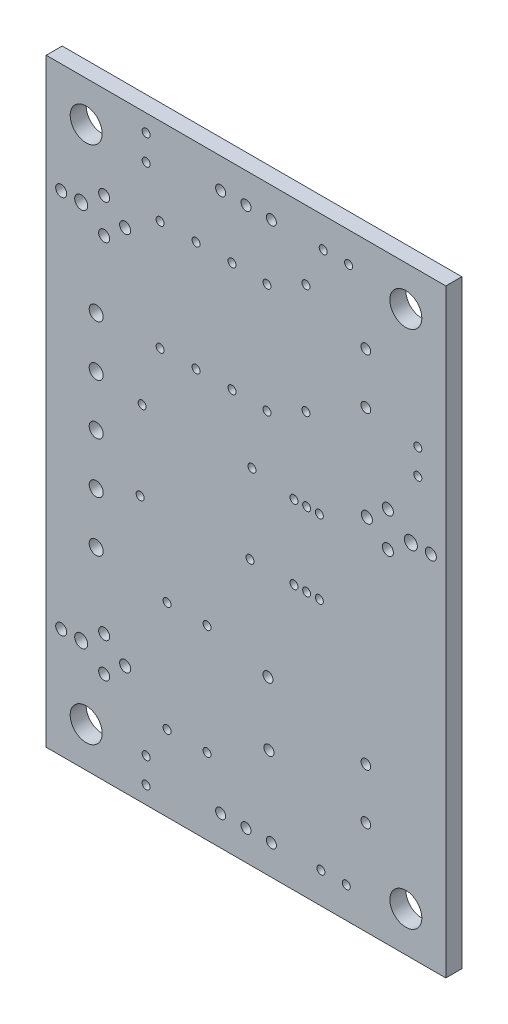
ISO-10303-21;
HEADER;
FILE_DESCRIPTION(('STEP AP214'),'2;1');
FILE_NAME('part.step','',(''),(''),'','','');
FILE_SCHEMA(('AUTOMOTIVE_DESIGN { 1 0 10303 214 1 1 1 1 }'));
ENDSEC;
DATA;
#1=APPLICATION_CONTEXT('core data for automotive mechanical design processes');
#2=APPLICATION_PROTOCOL_DEFINITION('international standard','automotive_design',2000,#1);
#3=PRODUCT_CONTEXT('',#1,'mechanical');
#4=PRODUCT('Part','Part','',(#3));
#5=PRODUCT_RELATED_PRODUCT_CATEGORY('part','',(#4));
#6=PRODUCT_DEFINITION_FORMATION('','',#4);
#7=PRODUCT_DEFINITION_CONTEXT('part definition',#1,'design');
#8=PRODUCT_DEFINITION('design','',#6,#7);
#9=PRODUCT_DEFINITION_SHAPE('','',#8);
#10=(LENGTH_UNIT() NAMED_UNIT(*) SI_UNIT(.MILLI.,.METRE.));
#11=(NAMED_UNIT(*) PLANE_ANGLE_UNIT() SI_UNIT($,.RADIAN.));
#12=(NAMED_UNIT(*) SI_UNIT($,.STERADIAN.) SOLID_ANGLE_UNIT());
#13=UNCERTAINTY_MEASURE_WITH_UNIT(LENGTH_MEASURE(1.E-05),#10,'distance_accuracy_value','');
#14=(GEOMETRIC_REPRESENTATION_CONTEXT(3) GLOBAL_UNCERTAINTY_ASSIGNED_CONTEXT((#13)) GLOBAL_UNIT_ASSIGNED_CONTEXT((#10,
#11,#12)) REPRESENTATION_CONTEXT('',''));
#15=CARTESIAN_POINT('',(0.,0.,0.));
#16=DIRECTION('',(0.,0.,1.));
#17=DIRECTION('',(1.,0.,0.));
#18=AXIS2_PLACEMENT_3D('',#15,#16,#17);
#19=CARTESIAN_POINT('',(0.,0.,1.6));
#20=DIRECTION('',(0.,0.,-1.));
#21=DIRECTION('',(-1.,0.,0.));
#22=AXIS2_PLACEMENT_3D('',#19,#20,#21);
#23=PLANE('',#22);
#24=DIRECTION('',(0.,-1.,0.));
#25=VECTOR('',#24,1.);
#26=CARTESIAN_POINT('',(0.,0.,1.6));
#27=LINE('',#26,#25);
#28=CARTESIAN_POINT('',(0.,60.0096997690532,1.6));
#29=VERTEX_POINT('',#28);
#30=CARTESIAN_POINT('',(0.,0.,1.6));
#31=VERTEX_POINT('',#30);
#32=EDGE_CURVE('E87',#29,#31,#27,.T.);
#33=ORIENTED_EDGE('',*,*,#32,.T.);
#34=DIRECTION('',(1.,0.,0.));
#35=VECTOR('',#34,1.);
#36=CARTESIAN_POINT('',(40.0064665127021,0.,1.6));
#37=LINE('',#36,#35);
#38=CARTESIAN_POINT('',(40.0064665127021,0.,1.6));
#39=VERTEX_POINT('',#38);
#40=EDGE_CURVE('E82',#31,#39,#37,.T.);
#41=ORIENTED_EDGE('',*,*,#40,.T.);
#42=DIRECTION('',(0.,1.,0.));
#43=VECTOR('',#42,1.);
#44=CARTESIAN_POINT('',(40.0064665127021,60.0096997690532,1.6));
#45=LINE('',#44,#43);
#46=CARTESIAN_POINT('',(40.0064665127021,60.0096997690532,1.6));
#47=VERTEX_POINT('',#46);
#48=EDGE_CURVE('E85',#39,#47,#45,.T.);
#49=ORIENTED_EDGE('',*,*,#48,.T.);
#50=DIRECTION('',(-1.,0.,0.));
#51=VECTOR('',#50,1.);
#52=CARTESIAN_POINT('',(0.,60.0096997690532,1.6));
#53=LINE('',#52,#51);
#54=EDGE_CURVE('E52',#47,#29,#53,.T.);
#55=ORIENTED_EDGE('',*,*,#54,.T.);
#56=EDGE_LOOP('',(#33,#41,#49,#55));
#57=FACE_BOUND('',#56,.T.);
#58=CARTESIAN_POINT('',(37.2069284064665,42.107390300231,1.6));
#59=DIRECTION('',(0.,0.,1.));
#60=DIRECTION('',(1.,0.,0.));
#61=AXIS2_PLACEMENT_3D('',#58,#59,#60);
#62=CIRCLE('',#61,0.398845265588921);
#63=CARTESIAN_POINT('',(37.6057736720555,42.107390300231,1.6));
#64=VERTEX_POINT('',#63);
#65=EDGE_CURVE('E102',#64,#64,#62,.T.);
#66=ORIENTED_EDGE('',*,*,#65,.F.);
#67=EDGE_LOOP('',(#66));
#68=FACE_BOUND('',#67,.T.);
#69=CARTESIAN_POINT('',(37.2069284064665,44.647806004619,1.6));
#70=DIRECTION('',(0.,0.,1.));
#71=DIRECTION('',(1.,0.,0.));
#72=AXIS2_PLACEMENT_3D('',#69,#70,#71);
#73=CIRCLE('',#72,0.398845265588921);
#74=CARTESIAN_POINT('',(37.6057736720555,44.647806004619,1.6));
#75=VERTEX_POINT('',#74);
#76=EDGE_CURVE('E117',#75,#75,#73,.T.);
#77=ORIENTED_EDGE('',*,*,#76,.F.);
#78=EDGE_LOOP('',(#77));
#79=FACE_BOUND('',#78,.T.);
#80=CARTESIAN_POINT('',(5.00207852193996,35.0856812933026,1.6));
#81=DIRECTION('',(0.,0.,1.));
#82=DIRECTION('',(1.,0.,0.));
#83=AXIS2_PLACEMENT_3D('',#80,#81,#82);
#84=CIRCLE('',#83,0.701154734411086);
#85=CARTESIAN_POINT('',(5.70323325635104,35.0856812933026,1.6));
#86=VERTEX_POINT('',#85);
#87=EDGE_CURVE('E123',#86,#86,#84,.T.);
#88=ORIENTED_EDGE('',*,*,#87,.F.);
#89=EDGE_LOOP('',(#88));
#90=FACE_BOUND('',#89,.T.);
#91=CARTESIAN_POINT('',(5.00207852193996,40.1665127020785,1.6));
#92=DIRECTION('',(0.,0.,1.));
#93=DIRECTION('',(1.,0.,0.));
#94=AXIS2_PLACEMENT_3D('',#91,#92,#93);
#95=CIRCLE('',#94,0.701154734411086);
#96=CARTESIAN_POINT('',(5.70323325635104,40.1665127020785,1.6));
#97=VERTEX_POINT('',#96);
#98=EDGE_CURVE('E129',#97,#97,#95,.T.);
#99=ORIENTED_EDGE('',*,*,#98,.F.);
#100=EDGE_LOOP('',(#99));
#101=FACE_BOUND('',#100,.T.);
#102=CARTESIAN_POINT('',(5.00207852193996,30.0048498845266,1.6));
#103=DIRECTION('',(0.,0.,1.));
#104=DIRECTION('',(1.,0.,0.));
#105=AXIS2_PLACEMENT_3D('',#102,#103,#104);
#106=CIRCLE('',#105,0.701154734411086);
#107=CARTESIAN_POINT('',(5.70323325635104,30.0048498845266,1.6));
#108=VERTEX_POINT('',#107);
#109=EDGE_CURVE('E135',#108,#108,#106,.T.);
#110=ORIENTED_EDGE('',*,*,#109,.F.);
#111=EDGE_LOOP('',(#110));
#112=FACE_BOUND('',#111,.T.);
#113=CARTESIAN_POINT('',(5.00207852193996,24.9240184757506,1.6));
#114=DIRECTION('',(0.,0.,1.));
#115=DIRECTION('',(1.,0.,0.));
#116=AXIS2_PLACEMENT_3D('',#113,#114,#115);
#117=CIRCLE('',#116,0.701154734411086);
#118=CARTESIAN_POINT('',(5.70323325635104,24.9240184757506,1.6));
#119=VERTEX_POINT('',#118);
#120=EDGE_CURVE('E141',#119,#119,#117,.T.);
#121=ORIENTED_EDGE('',*,*,#120,.F.);
#122=EDGE_LOOP('',(#121));
#123=FACE_BOUND('',#122,.T.);
#124=CARTESIAN_POINT('',(5.00207852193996,19.8431870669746,1.6));
#125=DIRECTION('',(0.,0.,1.));
#126=DIRECTION('',(1.,0.,0.));
#127=AXIS2_PLACEMENT_3D('',#124,#125,#126);
#128=CIRCLE('',#127,0.701154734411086);
#129=CARTESIAN_POINT('',(5.70323325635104,19.8431870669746,1.6));
#130=VERTEX_POINT('',#129);
#131=EDGE_CURVE('E147',#130,#130,#128,.T.);
#132=ORIENTED_EDGE('',*,*,#131,.F.);
#133=EDGE_LOOP('',(#132));
#134=FACE_BOUND('',#133,.T.);
#135=CARTESIAN_POINT('',(32.0041570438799,45.4683602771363,1.6));
#136=DIRECTION('',(0.,0.,1.));
#137=DIRECTION('',(1.,0.,0.));
#138=AXIS2_PLACEMENT_3D('',#135,#136,#137);
#139=CIRCLE('',#138,0.482678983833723);
#140=CARTESIAN_POINT('',(32.4868360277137,45.4683602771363,1.6));
#141=VERTEX_POINT('',#140);
#142=EDGE_CURVE('E153',#141,#141,#139,.T.);
#143=ORIENTED_EDGE('',*,*,#142,.F.);
#144=EDGE_LOOP('',(#143));
#145=FACE_BOUND('',#144,.T.);
#146=CARTESIAN_POINT('',(32.0041570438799,50.5491916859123,1.6));
#147=DIRECTION('',(0.,0.,1.));
#148=DIRECTION('',(1.,0.,0.));
#149=AXIS2_PLACEMENT_3D('',#146,#147,#148);
#150=CIRCLE('',#149,0.482678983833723);
#151=CARTESIAN_POINT('',(32.4868360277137,50.5491916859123,1.6));
#152=VERTEX_POINT('',#151);
#153=EDGE_CURVE('E159',#152,#152,#150,.T.);
#154=ORIENTED_EDGE('',*,*,#153,.F.);
#155=EDGE_LOOP('',(#154));
#156=FACE_BOUND('',#155,.T.);
#157=CARTESIAN_POINT('',(32.0041570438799,9.46050808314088,1.6));
#158=DIRECTION('',(0.,0.,1.));
#159=DIRECTION('',(1.,0.,0.));
#160=AXIS2_PLACEMENT_3D('',#157,#158,#159);
#161=CIRCLE('',#160,0.482678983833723);
#162=CARTESIAN_POINT('',(32.4868360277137,9.46050808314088,1.6));
#163=VERTEX_POINT('',#162);
#164=EDGE_CURVE('E165',#163,#163,#161,.T.);
#165=ORIENTED_EDGE('',*,*,#164,.F.);
#166=EDGE_LOOP('',(#165));
#167=FACE_BOUND('',#166,.T.);
#168=CARTESIAN_POINT('',(32.0041570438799,14.5413394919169,1.6));
#169=DIRECTION('',(0.,0.,1.));
#170=DIRECTION('',(1.,0.,0.));
#171=AXIS2_PLACEMENT_3D('',#168,#169,#170);
#172=CIRCLE('',#171,0.482678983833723);
#173=CARTESIAN_POINT('',(32.4868360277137,14.5413394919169,1.6));
#174=VERTEX_POINT('',#173);
#175=EDGE_CURVE('E171',#174,#174,#172,.T.);
#176=ORIENTED_EDGE('',*,*,#175,.F.);
#177=EDGE_LOOP('',(#176));
#178=FACE_BOUND('',#177,.T.);
#179=CARTESIAN_POINT('',(1.49884526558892,11.0025404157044,1.6));
#180=DIRECTION('',(0.,0.,1.));
#181=DIRECTION('',(1.,0.,0.));
#182=AXIS2_PLACEMENT_3D('',#179,#180,#181);
#183=CIRCLE('',#182,0.551270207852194);
#184=CARTESIAN_POINT('',(2.05011547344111,11.0025404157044,1.6));
#185=VERTEX_POINT('',#184);
#186=EDGE_CURVE('E177',#185,#185,#183,.T.);
#187=ORIENTED_EDGE('',*,*,#186,.F.);
#188=EDGE_LOOP('',(#187));
#189=FACE_BOUND('',#188,.T.);
#190=CARTESIAN_POINT('',(7.90069284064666,11.0025404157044,1.6));
#191=DIRECTION('',(0.,0.,1.));
#192=DIRECTION('',(1.,0.,0.));
#193=AXIS2_PLACEMENT_3D('',#190,#191,#192);
#194=CIRCLE('',#193,0.551270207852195);
#195=CARTESIAN_POINT('',(8.45196304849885,11.0025404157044,1.6));
#196=VERTEX_POINT('',#195);
#197=EDGE_CURVE('E183',#196,#196,#194,.T.);
#198=ORIENTED_EDGE('',*,*,#197,.F.);
#199=EDGE_LOOP('',(#198));
#200=FACE_BOUND('',#199,.T.);
#201=CARTESIAN_POINT('',(5.79976905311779,9.25219399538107,1.6));
#202=DIRECTION('',(0.,0.,1.));
#203=DIRECTION('',(1.,0.,0.));
#204=AXIS2_PLACEMENT_3D('',#201,#202,#203);
#205=CIRCLE('',#204,0.551270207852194);
#206=CARTESIAN_POINT('',(6.35103926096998,9.25219399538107,1.6));
#207=VERTEX_POINT('',#206);
#208=EDGE_CURVE('E189',#207,#207,#205,.T.);
#209=ORIENTED_EDGE('',*,*,#208,.F.);
#210=EDGE_LOOP('',(#209));
#211=FACE_BOUND('',#210,.T.);
#212=CARTESIAN_POINT('',(5.79976905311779,12.7528868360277,1.6));
#213=DIRECTION('',(0.,0.,1.));
#214=DIRECTION('',(1.,0.,0.));
#215=AXIS2_PLACEMENT_3D('',#212,#213,#214);
#216=CIRCLE('',#215,0.551270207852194);
#217=CARTESIAN_POINT('',(6.35103926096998,12.7528868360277,1.6));
#218=VERTEX_POINT('',#217);
#219=EDGE_CURVE('E195',#218,#218,#216,.T.);
#220=ORIENTED_EDGE('',*,*,#219,.F.);
#221=EDGE_LOOP('',(#220));
#222=FACE_BOUND('',#221,.T.);
#223=CARTESIAN_POINT('',(3.50069284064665,11.0025404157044,1.6));
#224=DIRECTION('',(0.,0.,1.));
#225=DIRECTION('',(1.,0.,0.));
#226=AXIS2_PLACEMENT_3D('',#223,#224,#225);
#227=CIRCLE('',#226,0.650346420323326);
#228=CARTESIAN_POINT('',(4.15103926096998,11.0025404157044,1.6));
#229=VERTEX_POINT('',#228);
#230=EDGE_CURVE('E201',#229,#229,#227,.T.);
#231=ORIENTED_EDGE('',*,*,#230,.F.);
#232=EDGE_LOOP('',(#231));
#233=FACE_BOUND('',#232,.T.);
#234=CARTESIAN_POINT('',(1.49884526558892,49.0096997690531,1.6));
#235=DIRECTION('',(0.,0.,1.));
#236=DIRECTION('',(1.,0.,0.));
#237=AXIS2_PLACEMENT_3D('',#234,#235,#236);
#238=CIRCLE('',#237,0.551270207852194);
#239=CARTESIAN_POINT('',(2.05011547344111,49.0096997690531,1.6));
#240=VERTEX_POINT('',#239);
#241=EDGE_CURVE('E207',#240,#240,#238,.T.);
#242=ORIENTED_EDGE('',*,*,#241,.F.);
#243=EDGE_LOOP('',(#242));
#244=FACE_BOUND('',#243,.T.);
#245=CARTESIAN_POINT('',(7.90069284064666,49.0096997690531,1.6));
#246=DIRECTION('',(0.,0.,1.));
#247=DIRECTION('',(1.,0.,0.));
#248=AXIS2_PLACEMENT_3D('',#245,#246,#247);
#249=CIRCLE('',#248,0.551270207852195);
#250=CARTESIAN_POINT('',(8.45196304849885,49.0096997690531,1.6));
#251=VERTEX_POINT('',#250);
#252=EDGE_CURVE('E213',#251,#251,#249,.T.);
#253=ORIENTED_EDGE('',*,*,#252,.F.);
#254=EDGE_LOOP('',(#253));
#255=FACE_BOUND('',#254,.T.);
#256=CARTESIAN_POINT('',(5.79976905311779,47.2593533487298,1.6));
#257=DIRECTION('',(0.,0.,1.));
#258=DIRECTION('',(1.,0.,0.));
#259=AXIS2_PLACEMENT_3D('',#256,#257,#258);
#260=CIRCLE('',#259,0.551270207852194);
#261=CARTESIAN_POINT('',(6.35103926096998,47.2593533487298,1.6));
#262=VERTEX_POINT('',#261);
#263=EDGE_CURVE('E219',#262,#262,#260,.T.);
#264=ORIENTED_EDGE('',*,*,#263,.F.);
#265=EDGE_LOOP('',(#264));
#266=FACE_BOUND('',#265,.T.);
#267=CARTESIAN_POINT('',(5.79976905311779,50.7600461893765,1.6));
#268=DIRECTION('',(0.,0.,1.));
#269=DIRECTION('',(1.,0.,0.));
#270=AXIS2_PLACEMENT_3D('',#267,#268,#269);
#271=CIRCLE('',#270,0.551270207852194);
#272=CARTESIAN_POINT('',(6.35103926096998,50.7600461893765,1.6));
#273=VERTEX_POINT('',#272);
#274=EDGE_CURVE('E225',#273,#273,#271,.T.);
#275=ORIENTED_EDGE('',*,*,#274,.F.);
#276=EDGE_LOOP('',(#275));
#277=FACE_BOUND('',#276,.T.);
#278=CARTESIAN_POINT('',(3.50069284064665,49.0096997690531,1.6));
#279=DIRECTION('',(0.,0.,1.));
#280=DIRECTION('',(1.,0.,0.));
#281=AXIS2_PLACEMENT_3D('',#278,#279,#280);
#282=CIRCLE('',#281,0.650346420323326);
#283=CARTESIAN_POINT('',(4.15103926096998,49.0096997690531,1.6));
#284=VERTEX_POINT('',#283);
#285=EDGE_CURVE('E231',#284,#284,#282,.T.);
#286=ORIENTED_EDGE('',*,*,#285,.F.);
#287=EDGE_LOOP('',(#286));
#288=FACE_BOUND('',#287,.T.);
#289=CARTESIAN_POINT('',(38.5076212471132,36.005311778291,1.6));
#290=DIRECTION('',(0.,0.,1.));
#291=DIRECTION('',(1.,0.,0.));
#292=AXIS2_PLACEMENT_3D('',#289,#290,#291);
#293=CIRCLE('',#292,0.551270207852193);
#294=CARTESIAN_POINT('',(39.0588914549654,36.005311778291,1.6));
#295=VERTEX_POINT('',#294);
#296=EDGE_CURVE('E237',#295,#295,#293,.T.);
#297=ORIENTED_EDGE('',*,*,#296,.F.);
#298=EDGE_LOOP('',(#297));
#299=FACE_BOUND('',#298,.T.);
#300=CARTESIAN_POINT('',(32.1057736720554,36.005311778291,1.6));
#301=DIRECTION('',(0.,0.,1.));
#302=DIRECTION('',(1.,0.,0.));
#303=AXIS2_PLACEMENT_3D('',#300,#301,#302);
#304=CIRCLE('',#303,0.551270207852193);
#305=CARTESIAN_POINT('',(32.6570438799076,36.005311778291,1.6));
#306=VERTEX_POINT('',#305);
#307=EDGE_CURVE('E243',#306,#306,#304,.T.);
#308=ORIENTED_EDGE('',*,*,#307,.F.);
#309=EDGE_LOOP('',(#308));
#310=FACE_BOUND('',#309,.T.);
#311=CARTESIAN_POINT('',(34.2066974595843,37.7556581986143,1.6));
#312=DIRECTION('',(0.,0.,1.));
#313=DIRECTION('',(1.,0.,0.));
#314=AXIS2_PLACEMENT_3D('',#311,#312,#313);
#315=CIRCLE('',#314,0.551270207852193);
#316=CARTESIAN_POINT('',(34.7579676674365,37.7556581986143,1.6));
#317=VERTEX_POINT('',#316);
#318=EDGE_CURVE('E249',#317,#317,#315,.T.);
#319=ORIENTED_EDGE('',*,*,#318,.F.);
#320=EDGE_LOOP('',(#319));
#321=FACE_BOUND('',#320,.T.);
#322=CARTESIAN_POINT('',(34.2066974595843,34.2549653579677,1.6));
#323=DIRECTION('',(0.,0.,1.));
#324=DIRECTION('',(1.,0.,0.));
#325=AXIS2_PLACEMENT_3D('',#322,#323,#324);
#326=CIRCLE('',#325,0.551270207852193);
#327=CARTESIAN_POINT('',(34.7579676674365,34.2549653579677,1.6));
#328=VERTEX_POINT('',#327);
#329=EDGE_CURVE('E255',#328,#328,#326,.T.);
#330=ORIENTED_EDGE('',*,*,#329,.F.);
#331=EDGE_LOOP('',(#330));
#332=FACE_BOUND('',#331,.T.);
#333=CARTESIAN_POINT('',(36.5057736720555,36.005311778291,1.6));
#334=DIRECTION('',(0.,0.,1.));
#335=DIRECTION('',(1.,0.,0.));
#336=AXIS2_PLACEMENT_3D('',#333,#334,#335);
#337=CIRCLE('',#336,0.650346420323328);
#338=CARTESIAN_POINT('',(37.1561200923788,36.005311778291,1.6));
#339=VERTEX_POINT('',#338);
#340=EDGE_CURVE('E261',#339,#339,#337,.T.);
#341=ORIENTED_EDGE('',*,*,#340,.F.);
#342=EDGE_LOOP('',(#341));
#343=FACE_BOUND('',#342,.T.);
#344=CARTESIAN_POINT('',(4.00115473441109,4.00115473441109,1.6));
#345=DIRECTION('',(0.,0.,1.));
#346=DIRECTION('',(1.,0.,0.));
#347=AXIS2_PLACEMENT_3D('',#344,#345,#346);
#348=CIRCLE('',#347,1.60046189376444);
#349=CARTESIAN_POINT('',(5.60161662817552,4.00115473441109,1.6));
#350=VERTEX_POINT('',#349);
#351=EDGE_CURVE('E267',#350,#350,#348,.T.);
#352=ORIENTED_EDGE('',*,*,#351,.F.);
#353=EDGE_LOOP('',(#352));
#354=FACE_BOUND('',#353,.T.);
#355=CARTESIAN_POINT('',(4.00115473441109,56.0085450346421,1.6));
#356=DIRECTION('',(0.,0.,1.));
#357=DIRECTION('',(1.,0.,0.));
#358=AXIS2_PLACEMENT_3D('',#355,#356,#357);
#359=CIRCLE('',#358,1.60046189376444);
#360=CARTESIAN_POINT('',(5.60161662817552,56.0085450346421,1.6));
#361=VERTEX_POINT('',#360);
#362=EDGE_CURVE('E273',#361,#361,#359,.T.);
#363=ORIENTED_EDGE('',*,*,#362,.F.);
#364=EDGE_LOOP('',(#363));
#365=FACE_BOUND('',#364,.T.);
#366=CARTESIAN_POINT('',(36.005311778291,4.00115473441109,1.6));
#367=DIRECTION('',(0.,0.,1.));
#368=DIRECTION('',(1.,0.,0.));
#369=AXIS2_PLACEMENT_3D('',#366,#367,#368);
#370=CIRCLE('',#369,1.60046189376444);
#371=CARTESIAN_POINT('',(37.6057736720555,4.00115473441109,1.6));
#372=VERTEX_POINT('',#371);
#373=EDGE_CURVE('E279',#372,#372,#370,.T.);
#374=ORIENTED_EDGE('',*,*,#373,.F.);
#375=EDGE_LOOP('',(#374));
#376=FACE_BOUND('',#375,.T.);
#377=CARTESIAN_POINT('',(36.005311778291,56.0085450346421,1.6));
#378=DIRECTION('',(0.,0.,1.));
#379=DIRECTION('',(1.,0.,0.));
#380=AXIS2_PLACEMENT_3D('',#377,#378,#379);
#381=CIRCLE('',#380,1.60046189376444);
#382=CARTESIAN_POINT('',(37.6057736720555,56.0085450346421,1.6));
#383=VERTEX_POINT('',#382);
#384=EDGE_CURVE('E285',#383,#383,#381,.T.);
#385=ORIENTED_EDGE('',*,*,#384,.F.);
#386=EDGE_LOOP('',(#385));
#387=FACE_BOUND('',#386,.T.);
#388=CARTESIAN_POINT('',(17.4628175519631,3.00023094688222,1.6));
#389=DIRECTION('',(0.,0.,1.));
#390=DIRECTION('',(1.,0.,0.));
#391=AXIS2_PLACEMENT_3D('',#388,#389,#390);
#392=CIRCLE('',#391,0.500461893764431);
#393=CARTESIAN_POINT('',(17.9632794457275,3.00023094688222,1.6));
#394=VERTEX_POINT('',#393);
#395=EDGE_CURVE('E291',#394,#394,#392,.T.);
#396=ORIENTED_EDGE('',*,*,#395,.F.);
#397=EDGE_LOOP('',(#396));
#398=FACE_BOUND('',#397,.T.);
#399=CARTESIAN_POINT('',(20.003233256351,3.00023094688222,1.6));
#400=DIRECTION('',(0.,0.,1.));
#401=DIRECTION('',(1.,0.,0.));
#402=AXIS2_PLACEMENT_3D('',#399,#400,#401);
#403=CIRCLE('',#402,0.500461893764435);
#404=CARTESIAN_POINT('',(20.5036951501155,3.00023094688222,1.6));
#405=VERTEX_POINT('',#404);
#406=EDGE_CURVE('E297',#405,#405,#403,.T.);
#407=ORIENTED_EDGE('',*,*,#406,.F.);
#408=EDGE_LOOP('',(#407));
#409=FACE_BOUND('',#408,.T.);
#410=CARTESIAN_POINT('',(22.543648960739,3.00023094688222,1.6));
#411=DIRECTION('',(0.,0.,1.));
#412=DIRECTION('',(1.,0.,0.));
#413=AXIS2_PLACEMENT_3D('',#410,#411,#412);
#414=CIRCLE('',#413,0.500461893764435);
#415=CARTESIAN_POINT('',(23.0441108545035,3.00023094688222,1.6));
#416=VERTEX_POINT('',#415);
#417=EDGE_CURVE('E303',#416,#416,#414,.T.);
#418=ORIENTED_EDGE('',*,*,#417,.F.);
#419=EDGE_LOOP('',(#418));
#420=FACE_BOUND('',#419,.T.);
#421=CARTESIAN_POINT('',(22.543648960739,57.0094688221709,1.6));
#422=DIRECTION('',(0.,0.,1.));
#423=DIRECTION('',(1.,0.,0.));
#424=AXIS2_PLACEMENT_3D('',#421,#422,#423);
#425=CIRCLE('',#424,0.500461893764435);
#426=CARTESIAN_POINT('',(23.0441108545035,57.0094688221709,1.6));
#427=VERTEX_POINT('',#426);
#428=EDGE_CURVE('E309',#427,#427,#425,.T.);
#429=ORIENTED_EDGE('',*,*,#428,.F.);
#430=EDGE_LOOP('',(#429));
#431=FACE_BOUND('',#430,.T.);
#432=CARTESIAN_POINT('',(20.003233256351,57.0094688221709,1.6));
#433=DIRECTION('',(0.,0.,1.));
#434=DIRECTION('',(1.,0.,0.));
#435=AXIS2_PLACEMENT_3D('',#432,#433,#434);
#436=CIRCLE('',#435,0.500461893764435);
#437=CARTESIAN_POINT('',(20.5036951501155,57.0094688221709,1.6));
#438=VERTEX_POINT('',#437);
#439=EDGE_CURVE('E315',#438,#438,#436,.T.);
#440=ORIENTED_EDGE('',*,*,#439,.F.);
#441=EDGE_LOOP('',(#440));
#442=FACE_BOUND('',#441,.T.);
#443=CARTESIAN_POINT('',(17.4628175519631,57.0094688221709,1.6));
#444=DIRECTION('',(0.,0.,1.));
#445=DIRECTION('',(1.,0.,0.));
#446=AXIS2_PLACEMENT_3D('',#443,#444,#445);
#447=CIRCLE('',#446,0.500461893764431);
#448=CARTESIAN_POINT('',(17.9632794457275,57.0094688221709,1.6));
#449=VERTEX_POINT('',#448);
#450=EDGE_CURVE('E321',#449,#449,#447,.T.);
#451=ORIENTED_EDGE('',*,*,#450,.F.);
#452=EDGE_LOOP('',(#451));
#453=FACE_BOUND('',#452,.T.);
#454=CARTESIAN_POINT('',(10.0016166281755,1.73002309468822,1.6));
#455=DIRECTION('',(0.,0.,1.));
#456=DIRECTION('',(1.,0.,0.));
#457=AXIS2_PLACEMENT_3D('',#454,#455,#456);
#458=CIRCLE('',#457,0.398845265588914);
#459=CARTESIAN_POINT('',(10.4004618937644,1.73002309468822,1.6));
#460=VERTEX_POINT('',#459);
#461=EDGE_CURVE('E327',#460,#460,#458,.T.);
#462=ORIENTED_EDGE('',*,*,#461,.F.);
#463=EDGE_LOOP('',(#462));
#464=FACE_BOUND('',#463,.T.);
#465=CARTESIAN_POINT('',(10.0016166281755,4.27043879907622,1.6));
#466=DIRECTION('',(0.,0.,1.));
#467=DIRECTION('',(1.,0.,0.));
#468=AXIS2_PLACEMENT_3D('',#465,#466,#467);
#469=CIRCLE('',#468,0.398845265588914);
#470=CARTESIAN_POINT('',(10.4004618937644,4.27043879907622,1.6));
#471=VERTEX_POINT('',#470);
#472=EDGE_CURVE('E333',#471,#471,#469,.T.);
#473=ORIENTED_EDGE('',*,*,#472,.F.);
#474=EDGE_LOOP('',(#473));
#475=FACE_BOUND('',#474,.T.);
#476=CARTESIAN_POINT('',(27.5050808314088,3.09930715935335,1.6));
#477=DIRECTION('',(0.,0.,1.));
#478=DIRECTION('',(1.,0.,0.));
#479=AXIS2_PLACEMENT_3D('',#476,#477,#478);
#480=CIRCLE('',#479,0.398845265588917);
#481=CARTESIAN_POINT('',(27.9039260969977,3.09930715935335,1.6));
#482=VERTEX_POINT('',#481);
#483=EDGE_CURVE('E339',#482,#482,#480,.T.);
#484=ORIENTED_EDGE('',*,*,#483,.F.);
#485=EDGE_LOOP('',(#484));
#486=FACE_BOUND('',#485,.T.);
#487=CARTESIAN_POINT('',(30.0454965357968,3.09930715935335,1.6));
#488=DIRECTION('',(0.,0.,1.));
#489=DIRECTION('',(1.,0.,0.));
#490=AXIS2_PLACEMENT_3D('',#487,#488,#489);
#491=CIRCLE('',#490,0.398845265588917);
#492=CARTESIAN_POINT('',(30.4443418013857,3.09930715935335,1.6));
#493=VERTEX_POINT('',#492);
#494=EDGE_CURVE('E345',#493,#493,#491,.T.);
#495=ORIENTED_EDGE('',*,*,#494,.F.);
#496=EDGE_LOOP('',(#495));
#497=FACE_BOUND('',#496,.T.);
#498=CARTESIAN_POINT('',(10.0016166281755,55.7392609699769,1.6));
#499=DIRECTION('',(0.,0.,1.));
#500=DIRECTION('',(1.,0.,0.));
#501=AXIS2_PLACEMENT_3D('',#498,#499,#500);
#502=CIRCLE('',#501,0.398845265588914);
#503=CARTESIAN_POINT('',(10.4004618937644,55.7392609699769,1.6));
#504=VERTEX_POINT('',#503);
#505=EDGE_CURVE('E351',#504,#504,#502,.T.);
#506=ORIENTED_EDGE('',*,*,#505,.F.);
#507=EDGE_LOOP('',(#506));
#508=FACE_BOUND('',#507,.T.);
#509=CARTESIAN_POINT('',(10.0016166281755,58.2796766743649,1.6));
#510=DIRECTION('',(0.,0.,1.));
#511=DIRECTION('',(1.,0.,0.));
#512=AXIS2_PLACEMENT_3D('',#509,#510,#511);
#513=CIRCLE('',#512,0.398845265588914);
#514=CARTESIAN_POINT('',(10.4004618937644,58.2796766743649,1.6));
#515=VERTEX_POINT('',#514);
#516=EDGE_CURVE('E357',#515,#515,#513,.T.);
#517=ORIENTED_EDGE('',*,*,#516,.F.);
#518=EDGE_LOOP('',(#517));
#519=FACE_BOUND('',#518,.T.);
#520=CARTESIAN_POINT('',(27.7337182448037,57.0094688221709,1.6));
#521=DIRECTION('',(0.,0.,1.));
#522=DIRECTION('',(1.,0.,0.));
#523=AXIS2_PLACEMENT_3D('',#520,#521,#522);
#524=CIRCLE('',#523,0.398845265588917);
#525=CARTESIAN_POINT('',(28.1325635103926,57.0094688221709,1.6));
#526=VERTEX_POINT('',#525);
#527=EDGE_CURVE('E363',#526,#526,#524,.T.);
#528=ORIENTED_EDGE('',*,*,#527,.F.);
#529=EDGE_LOOP('',(#528));
#530=FACE_BOUND('',#529,.T.);
#531=CARTESIAN_POINT('',(30.2741339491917,57.0094688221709,1.6));
#532=DIRECTION('',(0.,0.,1.));
#533=DIRECTION('',(1.,0.,0.));
#534=AXIS2_PLACEMENT_3D('',#531,#532,#533);
#535=CIRCLE('',#534,0.398845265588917);
#536=CARTESIAN_POINT('',(30.6729792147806,57.0094688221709,1.6));
#537=VERTEX_POINT('',#536);
#538=EDGE_CURVE('E369',#537,#537,#535,.T.);
#539=ORIENTED_EDGE('',*,*,#538,.F.);
#540=EDGE_LOOP('',(#539));
#541=FACE_BOUND('',#540,.T.);
#542=CARTESIAN_POINT('',(26.0036951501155,42.107390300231,1.6));
#543=DIRECTION('',(0.,0.,1.));
#544=DIRECTION('',(1.,0.,0.));
#545=AXIS2_PLACEMENT_3D('',#542,#543,#544);
#546=CIRCLE('',#545,0.398845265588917);
#547=CARTESIAN_POINT('',(26.4025404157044,42.107390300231,1.6));
#548=VERTEX_POINT('',#547);
#549=EDGE_CURVE('E375',#548,#548,#546,.T.);
#550=ORIENTED_EDGE('',*,*,#549,.F.);
#551=EDGE_LOOP('',(#550));
#552=FACE_BOUND('',#551,.T.);
#553=CARTESIAN_POINT('',(26.0036951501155,53.1099307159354,1.6));
#554=DIRECTION('',(0.,0.,1.));
#555=DIRECTION('',(1.,0.,0.));
#556=AXIS2_PLACEMENT_3D('',#553,#554,#555);
#557=CIRCLE('',#556,0.398845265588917);
#558=CARTESIAN_POINT('',(26.4025404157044,53.1099307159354,1.6));
#559=VERTEX_POINT('',#558);
#560=EDGE_CURVE('E381',#559,#559,#557,.T.);
#561=ORIENTED_EDGE('',*,*,#560,.F.);
#562=EDGE_LOOP('',(#561));
#563=FACE_BOUND('',#562,.T.);
#564=CARTESIAN_POINT('',(12.1025404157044,7.60092378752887,1.6));
#565=DIRECTION('',(0.,0.,1.));
#566=DIRECTION('',(1.,0.,0.));
#567=AXIS2_PLACEMENT_3D('',#564,#565,#566);
#568=CIRCLE('',#567,0.398845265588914);
#569=CARTESIAN_POINT('',(12.5013856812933,7.60092378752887,1.6));
#570=VERTEX_POINT('',#569);
#571=EDGE_CURVE('E387',#570,#570,#568,.T.);
#572=ORIENTED_EDGE('',*,*,#571,.F.);
#573=EDGE_LOOP('',(#572));
#574=FACE_BOUND('',#573,.T.);
#575=CARTESIAN_POINT('',(12.1025404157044,18.6034642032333,1.6));
#576=DIRECTION('',(0.,0.,1.));
#577=DIRECTION('',(1.,0.,0.));
#578=AXIS2_PLACEMENT_3D('',#575,#576,#577);
#579=CIRCLE('',#578,0.398845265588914);
#580=CARTESIAN_POINT('',(12.5013856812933,18.6034642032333,1.6));
#581=VERTEX_POINT('',#580);
#582=EDGE_CURVE('E393',#581,#581,#579,.T.);
#583=ORIENTED_EDGE('',*,*,#582,.F.);
#584=EDGE_LOOP('',(#583));
#585=FACE_BOUND('',#584,.T.);
#586=CARTESIAN_POINT('',(22.1041570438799,51.2071593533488,1.6));
#587=DIRECTION('',(0.,0.,1.));
#588=DIRECTION('',(1.,0.,0.));
#589=AXIS2_PLACEMENT_3D('',#586,#587,#588);
#590=CIRCLE('',#589,0.398845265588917);
#591=CARTESIAN_POINT('',(22.5030023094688,51.2071593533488,1.6));
#592=VERTEX_POINT('',#591);
#593=EDGE_CURVE('E399',#592,#592,#590,.T.);
#594=ORIENTED_EDGE('',*,*,#593,.F.);
#595=EDGE_LOOP('',(#594));
#596=FACE_BOUND('',#595,.T.);
#597=CARTESIAN_POINT('',(22.1041570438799,40.2071593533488,1.6));
#598=DIRECTION('',(0.,0.,1.));
#599=DIRECTION('',(1.,0.,0.));
#600=AXIS2_PLACEMENT_3D('',#597,#598,#599);
#601=CIRCLE('',#600,0.398845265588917);
#602=CARTESIAN_POINT('',(22.5030023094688,40.2071593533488,1.6));
#603=VERTEX_POINT('',#602);
#604=EDGE_CURVE('E405',#603,#603,#601,.T.);
#605=ORIENTED_EDGE('',*,*,#604,.F.);
#606=EDGE_LOOP('',(#605));
#607=FACE_BOUND('',#606,.T.);
#608=CARTESIAN_POINT('',(9.60277136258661,34.5064665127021,1.6));
#609=DIRECTION('',(0.,0.,1.));
#610=DIRECTION('',(1.,0.,0.));
#611=AXIS2_PLACEMENT_3D('',#608,#609,#610);
#612=CIRCLE('',#611,0.398845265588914);
#613=CARTESIAN_POINT('',(10.0016166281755,34.5064665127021,1.6));
#614=VERTEX_POINT('',#613);
#615=EDGE_CURVE('E411',#614,#614,#612,.T.);
#616=ORIENTED_EDGE('',*,*,#615,.F.);
#617=EDGE_LOOP('',(#616));
#618=FACE_BOUND('',#617,.T.);
#619=CARTESIAN_POINT('',(20.6027713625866,34.5064665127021,1.6));
#620=DIRECTION('',(0.,0.,1.));
#621=DIRECTION('',(1.,0.,0.));
#622=AXIS2_PLACEMENT_3D('',#619,#620,#621);
#623=CIRCLE('',#622,0.398845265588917);
#624=CARTESIAN_POINT('',(21.0016166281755,34.5064665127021,1.6));
#625=VERTEX_POINT('',#624);
#626=EDGE_CURVE('E417',#625,#625,#623,.T.);
#627=ORIENTED_EDGE('',*,*,#626,.F.);
#628=EDGE_LOOP('',(#627));
#629=FACE_BOUND('',#628,.T.);
#630=CARTESIAN_POINT('',(16.1036951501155,7.60092378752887,1.6));
#631=DIRECTION('',(0.,0.,1.));
#632=DIRECTION('',(1.,0.,0.));
#633=AXIS2_PLACEMENT_3D('',#630,#631,#632);
#634=CIRCLE('',#633,0.398845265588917);
#635=CARTESIAN_POINT('',(16.5025404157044,7.60092378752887,1.6));
#636=VERTEX_POINT('',#635);
#637=EDGE_CURVE('E423',#636,#636,#634,.T.);
#638=ORIENTED_EDGE('',*,*,#637,.F.);
#639=EDGE_LOOP('',(#638));
#640=FACE_BOUND('',#639,.T.);
#641=CARTESIAN_POINT('',(16.1036951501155,18.6034642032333,1.6));
#642=DIRECTION('',(0.,0.,1.));
#643=DIRECTION('',(1.,0.,0.));
#644=AXIS2_PLACEMENT_3D('',#641,#642,#643);
#645=CIRCLE('',#644,0.398845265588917);
#646=CARTESIAN_POINT('',(16.5025404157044,18.6034642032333,1.6));
#647=VERTEX_POINT('',#646);
#648=EDGE_CURVE('E429',#647,#647,#645,.T.);
#649=ORIENTED_EDGE('',*,*,#648,.F.);
#650=EDGE_LOOP('',(#649));
#651=FACE_BOUND('',#650,.T.);
#652=CARTESIAN_POINT('',(11.4013856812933,40.3062355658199,1.6));
#653=DIRECTION('',(0.,0.,1.));
#654=DIRECTION('',(1.,0.,0.));
#655=AXIS2_PLACEMENT_3D('',#652,#653,#654);
#656=CIRCLE('',#655,0.398845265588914);
#657=CARTESIAN_POINT('',(11.8002309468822,40.3062355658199,1.6));
#658=VERTEX_POINT('',#657);
#659=EDGE_CURVE('E435',#658,#658,#656,.T.);
#660=ORIENTED_EDGE('',*,*,#659,.F.);
#661=EDGE_LOOP('',(#660));
#662=FACE_BOUND('',#661,.T.);
#663=CARTESIAN_POINT('',(11.4013856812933,51.3087759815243,1.6));
#664=DIRECTION('',(0.,0.,1.));
#665=DIRECTION('',(1.,0.,0.));
#666=AXIS2_PLACEMENT_3D('',#663,#664,#665);
#667=CIRCLE('',#666,0.398845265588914);
#668=CARTESIAN_POINT('',(11.8002309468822,51.3087759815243,1.6));
#669=VERTEX_POINT('',#668);
#670=EDGE_CURVE('E441',#669,#669,#667,.T.);
#671=ORIENTED_EDGE('',*,*,#670,.F.);
#672=EDGE_LOOP('',(#671));
#673=FACE_BOUND('',#672,.T.);
#674=CARTESIAN_POINT('',(9.40207852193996,26.5041570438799,1.6));
#675=DIRECTION('',(0.,0.,1.));
#676=DIRECTION('',(1.,0.,0.));
#677=AXIS2_PLACEMENT_3D('',#674,#675,#676);
#678=CIRCLE('',#677,0.398845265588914);
#679=CARTESIAN_POINT('',(9.80092378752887,26.5041570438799,1.6));
#680=VERTEX_POINT('',#679);
#681=EDGE_CURVE('E447',#680,#680,#678,.T.);
#682=ORIENTED_EDGE('',*,*,#681,.F.);
#683=EDGE_LOOP('',(#682));
#684=FACE_BOUND('',#683,.T.);
#685=CARTESIAN_POINT('',(20.40207852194,26.5041570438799,1.6));
#686=DIRECTION('',(0.,0.,1.));
#687=DIRECTION('',(1.,0.,0.));
#688=AXIS2_PLACEMENT_3D('',#685,#686,#687);
#689=CIRCLE('',#688,0.398845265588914);
#690=CARTESIAN_POINT('',(20.8009237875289,26.5041570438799,1.6));
#691=VERTEX_POINT('',#690);
#692=EDGE_CURVE('E453',#691,#691,#689,.T.);
#693=ORIENTED_EDGE('',*,*,#692,.F.);
#694=EDGE_LOOP('',(#693));
#695=FACE_BOUND('',#694,.T.);
#696=CARTESIAN_POINT('',(18.6034642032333,51.3087759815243,1.6));
#697=DIRECTION('',(0.,0.,1.));
#698=DIRECTION('',(1.,0.,0.));
#699=AXIS2_PLACEMENT_3D('',#696,#697,#698);
#700=CIRCLE('',#699,0.398845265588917);
#701=CARTESIAN_POINT('',(19.0023094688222,51.3087759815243,1.6));
#702=VERTEX_POINT('',#701);
#703=EDGE_CURVE('E459',#702,#702,#700,.T.);
#704=ORIENTED_EDGE('',*,*,#703,.F.);
#705=EDGE_LOOP('',(#704));
#706=FACE_BOUND('',#705,.T.);
#707=CARTESIAN_POINT('',(18.6034642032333,40.3062355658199,1.6));
#708=DIRECTION('',(0.,0.,1.));
#709=DIRECTION('',(1.,0.,0.));
#710=AXIS2_PLACEMENT_3D('',#707,#708,#709);
#711=CIRCLE('',#710,0.398845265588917);
#712=CARTESIAN_POINT('',(19.0023094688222,40.3062355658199,1.6));
#713=VERTEX_POINT('',#712);
#714=EDGE_CURVE('E465',#713,#713,#711,.T.);
#715=ORIENTED_EDGE('',*,*,#714,.F.);
#716=EDGE_LOOP('',(#715));
#717=FACE_BOUND('',#716,.T.);
#718=CARTESIAN_POINT('',(15.0036951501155,51.3087759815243,1.6));
#719=DIRECTION('',(0.,0.,1.));
#720=DIRECTION('',(1.,0.,0.));
#721=AXIS2_PLACEMENT_3D('',#718,#719,#720);
#722=CIRCLE('',#721,0.398845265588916);
#723=CARTESIAN_POINT('',(15.4025404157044,51.3087759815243,1.6));
#724=VERTEX_POINT('',#723);
#725=EDGE_CURVE('E471',#724,#724,#722,.T.);
#726=ORIENTED_EDGE('',*,*,#725,.F.);
#727=EDGE_LOOP('',(#726));
#728=FACE_BOUND('',#727,.T.);
#729=CARTESIAN_POINT('',(15.0036951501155,40.3062355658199,1.6));
#730=DIRECTION('',(0.,0.,1.));
#731=DIRECTION('',(1.,0.,0.));
#732=AXIS2_PLACEMENT_3D('',#729,#730,#731);
#733=CIRCLE('',#732,0.398845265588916);
#734=CARTESIAN_POINT('',(15.4025404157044,40.3062355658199,1.6));
#735=VERTEX_POINT('',#734);
#736=EDGE_CURVE('E477',#735,#735,#733,.T.);
#737=ORIENTED_EDGE('',*,*,#736,.F.);
#738=EDGE_LOOP('',(#737));
#739=FACE_BOUND('',#738,.T.);
#740=CARTESIAN_POINT('',(24.8046189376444,26.5041570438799,1.6));
#741=DIRECTION('',(0.,0.,1.));
#742=DIRECTION('',(1.,0.,0.));
#743=AXIS2_PLACEMENT_3D('',#740,#741,#742);
#744=CIRCLE('',#743,0.398845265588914);
#745=CARTESIAN_POINT('',(25.2034642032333,26.5041570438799,1.6));
#746=VERTEX_POINT('',#745);
#747=EDGE_CURVE('E483',#746,#746,#744,.T.);
#748=ORIENTED_EDGE('',*,*,#747,.F.);
#749=EDGE_LOOP('',(#748));
#750=FACE_BOUND('',#749,.T.);
#751=CARTESIAN_POINT('',(26.0748267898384,26.5041570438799,1.6));
#752=DIRECTION('',(0.,0.,1.));
#753=DIRECTION('',(1.,0.,0.));
#754=AXIS2_PLACEMENT_3D('',#751,#752,#753);
#755=CIRCLE('',#754,0.398845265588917);
#756=CARTESIAN_POINT('',(26.4736720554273,26.5041570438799,1.6));
#757=VERTEX_POINT('',#756);
#758=EDGE_CURVE('E489',#757,#757,#755,.T.);
#759=ORIENTED_EDGE('',*,*,#758,.F.);
#760=EDGE_LOOP('',(#759));
#761=FACE_BOUND('',#760,.T.);
#762=CARTESIAN_POINT('',(27.3450346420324,26.5041570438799,1.6));
#763=DIRECTION('',(0.,0.,1.));
#764=DIRECTION('',(1.,0.,0.));
#765=AXIS2_PLACEMENT_3D('',#762,#763,#764);
#766=CIRCLE('',#765,0.398845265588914);
#767=CARTESIAN_POINT('',(27.7438799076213,26.5041570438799,1.6));
#768=VERTEX_POINT('',#767);
#769=EDGE_CURVE('E495',#768,#768,#766,.T.);
#770=ORIENTED_EDGE('',*,*,#769,.F.);
#771=EDGE_LOOP('',(#770));
#772=FACE_BOUND('',#771,.T.);
#773=CARTESIAN_POINT('',(24.8046189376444,33.9043879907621,1.6));
#774=DIRECTION('',(0.,0.,1.));
#775=DIRECTION('',(1.,0.,0.));
#776=AXIS2_PLACEMENT_3D('',#773,#774,#775);
#777=CIRCLE('',#776,0.398845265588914);
#778=CARTESIAN_POINT('',(25.2034642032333,33.9043879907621,1.6));
#779=VERTEX_POINT('',#778);
#780=EDGE_CURVE('E501',#779,#779,#777,.T.);
#781=ORIENTED_EDGE('',*,*,#780,.F.);
#782=EDGE_LOOP('',(#781));
#783=FACE_BOUND('',#782,.T.);
#784=CARTESIAN_POINT('',(26.0748267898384,33.9043879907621,1.6));
#785=DIRECTION('',(0.,0.,1.));
#786=DIRECTION('',(1.,0.,0.));
#787=AXIS2_PLACEMENT_3D('',#784,#785,#786);
#788=CIRCLE('',#787,0.398845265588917);
#789=CARTESIAN_POINT('',(26.4736720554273,33.9043879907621,1.6));
#790=VERTEX_POINT('',#789);
#791=EDGE_CURVE('E507',#790,#790,#788,.T.);
#792=ORIENTED_EDGE('',*,*,#791,.F.);
#793=EDGE_LOOP('',(#792));
#794=FACE_BOUND('',#793,.T.);
#795=CARTESIAN_POINT('',(27.3450346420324,33.9043879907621,1.6));
#796=DIRECTION('',(0.,0.,1.));
#797=DIRECTION('',(1.,0.,0.));
#798=AXIS2_PLACEMENT_3D('',#795,#796,#797);
#799=CIRCLE('',#798,0.398845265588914);
#800=CARTESIAN_POINT('',(27.7438799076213,33.9043879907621,1.6));
#801=VERTEX_POINT('',#800);
#802=EDGE_CURVE('E513',#801,#801,#799,.T.);
#803=ORIENTED_EDGE('',*,*,#802,.F.);
#804=EDGE_LOOP('',(#803));
#805=FACE_BOUND('',#804,.T.);
#806=CARTESIAN_POINT('',(22.3048498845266,10.9009237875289,1.6));
#807=DIRECTION('',(0.,0.,1.));
#808=DIRECTION('',(1.,0.,0.));
#809=AXIS2_PLACEMENT_3D('',#806,#807,#808);
#810=CIRCLE('',#809,0.500461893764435);
#811=CARTESIAN_POINT('',(22.805311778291,10.9009237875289,1.6));
#812=VERTEX_POINT('',#811);
#813=EDGE_CURVE('E519',#812,#812,#810,.T.);
#814=ORIENTED_EDGE('',*,*,#813,.F.);
#815=EDGE_LOOP('',(#814));
#816=FACE_BOUND('',#815,.T.);
#817=CARTESIAN_POINT('',(22.2032332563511,17.2036951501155,1.6));
#818=DIRECTION('',(0.,0.,1.));
#819=DIRECTION('',(1.,0.,0.));
#820=AXIS2_PLACEMENT_3D('',#817,#818,#819);
#821=CIRCLE('',#820,0.500461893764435);
#822=CARTESIAN_POINT('',(22.7036951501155,17.2036951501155,1.6));
#823=VERTEX_POINT('',#822);
#824=EDGE_CURVE('E525',#823,#823,#821,.T.);
#825=ORIENTED_EDGE('',*,*,#824,.F.);
#826=EDGE_LOOP('',(#825));
#827=FACE_BOUND('',#826,.T.);
#828=ADVANCED_FACE('F35',(#57,#68,#79,#90,#101,#112,#123,#134,#145,#156,#167,#178,#189,#200,
#211,#222,#233,#244,#255,#266,#277,#288,#299,#310,#321,#332,#343,#354,#365,#376,#387,#398,#409,
#420,#431,#442,#453,#464,#475,#486,#497,#508,#519,#530,#541,#552,#563,#574,#585,#596,#607,#618,
#629,#640,#651,#662,#673,#684,#695,#706,#717,#728,#739,#750,#761,#772,#783,#794,#805,#816,#827),
#23,.F.);
#829=CARTESIAN_POINT('',(0.,0.,0.));
#830=DIRECTION('',(0.,0.,-1.));
#831=DIRECTION('',(-1.,0.,0.));
#832=AXIS2_PLACEMENT_3D('',#829,#830,#831);
#833=PLANE('',#832);
#834=CARTESIAN_POINT('',(22.3048498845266,10.9009237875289,0.));
#835=DIRECTION('',(0.,0.,1.));
#836=DIRECTION('',(1.,0.,0.));
#837=AXIS2_PLACEMENT_3D('',#834,#835,#836);
#838=CIRCLE('',#837,0.500461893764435);
#839=CARTESIAN_POINT('',(22.805311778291,10.9009237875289,0.));
#840=VERTEX_POINT('',#839);
#841=EDGE_CURVE('E522',#840,#840,#838,.T.);
#842=ORIENTED_EDGE('',*,*,#841,.T.);
#843=EDGE_LOOP('',(#842));
#844=FACE_BOUND('',#843,.T.);
#845=CARTESIAN_POINT('',(26.0748267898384,33.9043879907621,0.));
#846=DIRECTION('',(0.,0.,1.));
#847=DIRECTION('',(1.,0.,0.));
#848=AXIS2_PLACEMENT_3D('',#845,#846,#847);
#849=CIRCLE('',#848,0.398845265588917);
#850=CARTESIAN_POINT('',(26.4736720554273,33.9043879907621,0.));
#851=VERTEX_POINT('',#850);
#852=EDGE_CURVE('E510',#851,#851,#849,.T.);
#853=ORIENTED_EDGE('',*,*,#852,.T.);
#854=EDGE_LOOP('',(#853));
#855=FACE_BOUND('',#854,.T.);
#856=CARTESIAN_POINT('',(27.3450346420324,26.5041570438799,0.));
#857=DIRECTION('',(0.,0.,1.));
#858=DIRECTION('',(1.,0.,0.));
#859=AXIS2_PLACEMENT_3D('',#856,#857,#858);
#860=CIRCLE('',#859,0.398845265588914);
#861=CARTESIAN_POINT('',(27.7438799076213,26.5041570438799,0.));
#862=VERTEX_POINT('',#861);
#863=EDGE_CURVE('E498',#862,#862,#860,.T.);
#864=ORIENTED_EDGE('',*,*,#863,.T.);
#865=EDGE_LOOP('',(#864));
#866=FACE_BOUND('',#865,.T.);
#867=CARTESIAN_POINT('',(24.8046189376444,26.5041570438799,0.));
#868=DIRECTION('',(0.,0.,1.));
#869=DIRECTION('',(1.,0.,0.));
#870=AXIS2_PLACEMENT_3D('',#867,#868,#869);
#871=CIRCLE('',#870,0.398845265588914);
#872=CARTESIAN_POINT('',(25.2034642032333,26.5041570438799,0.));
#873=VERTEX_POINT('',#872);
#874=EDGE_CURVE('E486',#873,#873,#871,.T.);
#875=ORIENTED_EDGE('',*,*,#874,.T.);
#876=EDGE_LOOP('',(#875));
#877=FACE_BOUND('',#876,.T.);
#878=CARTESIAN_POINT('',(15.0036951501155,51.3087759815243,0.));
#879=DIRECTION('',(0.,0.,1.));
#880=DIRECTION('',(1.,0.,0.));
#881=AXIS2_PLACEMENT_3D('',#878,#879,#880);
#882=CIRCLE('',#881,0.398845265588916);
#883=CARTESIAN_POINT('',(15.4025404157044,51.3087759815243,0.));
#884=VERTEX_POINT('',#883);
#885=EDGE_CURVE('E474',#884,#884,#882,.T.);
#886=ORIENTED_EDGE('',*,*,#885,.T.);
#887=EDGE_LOOP('',(#886));
#888=FACE_BOUND('',#887,.T.);
#889=CARTESIAN_POINT('',(18.6034642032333,51.3087759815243,0.));
#890=DIRECTION('',(0.,0.,1.));
#891=DIRECTION('',(1.,0.,0.));
#892=AXIS2_PLACEMENT_3D('',#889,#890,#891);
#893=CIRCLE('',#892,0.398845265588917);
#894=CARTESIAN_POINT('',(19.0023094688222,51.3087759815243,0.));
#895=VERTEX_POINT('',#894);
#896=EDGE_CURVE('E462',#895,#895,#893,.T.);
#897=ORIENTED_EDGE('',*,*,#896,.T.);
#898=EDGE_LOOP('',(#897));
#899=FACE_BOUND('',#898,.T.);
#900=CARTESIAN_POINT('',(9.40207852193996,26.5041570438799,0.));
#901=DIRECTION('',(0.,0.,1.));
#902=DIRECTION('',(1.,0.,0.));
#903=AXIS2_PLACEMENT_3D('',#900,#901,#902);
#904=CIRCLE('',#903,0.398845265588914);
#905=CARTESIAN_POINT('',(9.80092378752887,26.5041570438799,0.));
#906=VERTEX_POINT('',#905);
#907=EDGE_CURVE('E450',#906,#906,#904,.T.);
#908=ORIENTED_EDGE('',*,*,#907,.T.);
#909=EDGE_LOOP('',(#908));
#910=FACE_BOUND('',#909,.T.);
#911=CARTESIAN_POINT('',(11.4013856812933,40.3062355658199,0.));
#912=DIRECTION('',(0.,0.,1.));
#913=DIRECTION('',(1.,0.,0.));
#914=AXIS2_PLACEMENT_3D('',#911,#912,#913);
#915=CIRCLE('',#914,0.398845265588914);
#916=CARTESIAN_POINT('',(11.8002309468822,40.3062355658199,0.));
#917=VERTEX_POINT('',#916);
#918=EDGE_CURVE('E438',#917,#917,#915,.T.);
#919=ORIENTED_EDGE('',*,*,#918,.T.);
#920=EDGE_LOOP('',(#919));
#921=FACE_BOUND('',#920,.T.);
#922=CARTESIAN_POINT('',(16.1036951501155,7.60092378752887,0.));
#923=DIRECTION('',(0.,0.,1.));
#924=DIRECTION('',(1.,0.,0.));
#925=AXIS2_PLACEMENT_3D('',#922,#923,#924);
#926=CIRCLE('',#925,0.398845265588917);
#927=CARTESIAN_POINT('',(16.5025404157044,7.60092378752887,0.));
#928=VERTEX_POINT('',#927);
#929=EDGE_CURVE('E426',#928,#928,#926,.T.);
#930=ORIENTED_EDGE('',*,*,#929,.T.);
#931=EDGE_LOOP('',(#930));
#932=FACE_BOUND('',#931,.T.);
#933=CARTESIAN_POINT('',(9.60277136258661,34.5064665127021,0.));
#934=DIRECTION('',(0.,0.,1.));
#935=DIRECTION('',(1.,0.,0.));
#936=AXIS2_PLACEMENT_3D('',#933,#934,#935);
#937=CIRCLE('',#936,0.398845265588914);
#938=CARTESIAN_POINT('',(10.0016166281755,34.5064665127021,0.));
#939=VERTEX_POINT('',#938);
#940=EDGE_CURVE('E414',#939,#939,#937,.T.);
#941=ORIENTED_EDGE('',*,*,#940,.T.);
#942=EDGE_LOOP('',(#941));
#943=FACE_BOUND('',#942,.T.);
#944=CARTESIAN_POINT('',(22.1041570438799,51.2071593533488,0.));
#945=DIRECTION('',(0.,0.,1.));
#946=DIRECTION('',(1.,0.,0.));
#947=AXIS2_PLACEMENT_3D('',#944,#945,#946);
#948=CIRCLE('',#947,0.398845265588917);
#949=CARTESIAN_POINT('',(22.5030023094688,51.2071593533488,0.));
#950=VERTEX_POINT('',#949);
#951=EDGE_CURVE('E402',#950,#950,#948,.T.);
#952=ORIENTED_EDGE('',*,*,#951,.T.);
#953=EDGE_LOOP('',(#952));
#954=FACE_BOUND('',#953,.T.);
#955=CARTESIAN_POINT('',(12.1025404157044,7.60092378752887,0.));
#956=DIRECTION('',(0.,0.,1.));
#957=DIRECTION('',(1.,0.,0.));
#958=AXIS2_PLACEMENT_3D('',#955,#956,#957);
#959=CIRCLE('',#958,0.398845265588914);
#960=CARTESIAN_POINT('',(12.5013856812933,7.60092378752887,0.));
#961=VERTEX_POINT('',#960);
#962=EDGE_CURVE('E390',#961,#961,#959,.T.);
#963=ORIENTED_EDGE('',*,*,#962,.T.);
#964=EDGE_LOOP('',(#963));
#965=FACE_BOUND('',#964,.T.);
#966=CARTESIAN_POINT('',(26.0036951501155,42.107390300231,0.));
#967=DIRECTION('',(0.,0.,1.));
#968=DIRECTION('',(1.,0.,0.));
#969=AXIS2_PLACEMENT_3D('',#966,#967,#968);
#970=CIRCLE('',#969,0.398845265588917);
#971=CARTESIAN_POINT('',(26.4025404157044,42.107390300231,0.));
#972=VERTEX_POINT('',#971);
#973=EDGE_CURVE('E378',#972,#972,#970,.T.);
#974=ORIENTED_EDGE('',*,*,#973,.T.);
#975=EDGE_LOOP('',(#974));
#976=FACE_BOUND('',#975,.T.);
#977=CARTESIAN_POINT('',(27.7337182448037,57.0094688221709,0.));
#978=DIRECTION('',(0.,0.,1.));
#979=DIRECTION('',(1.,0.,0.));
#980=AXIS2_PLACEMENT_3D('',#977,#978,#979);
#981=CIRCLE('',#980,0.398845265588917);
#982=CARTESIAN_POINT('',(28.1325635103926,57.0094688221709,0.));
#983=VERTEX_POINT('',#982);
#984=EDGE_CURVE('E366',#983,#983,#981,.T.);
#985=ORIENTED_EDGE('',*,*,#984,.T.);
#986=EDGE_LOOP('',(#985));
#987=FACE_BOUND('',#986,.T.);
#988=CARTESIAN_POINT('',(10.0016166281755,55.7392609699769,0.));
#989=DIRECTION('',(0.,0.,1.));
#990=DIRECTION('',(1.,0.,0.));
#991=AXIS2_PLACEMENT_3D('',#988,#989,#990);
#992=CIRCLE('',#991,0.398845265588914);
#993=CARTESIAN_POINT('',(10.4004618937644,55.7392609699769,0.));
#994=VERTEX_POINT('',#993);
#995=EDGE_CURVE('E354',#994,#994,#992,.T.);
#996=ORIENTED_EDGE('',*,*,#995,.T.);
#997=EDGE_LOOP('',(#996));
#998=FACE_BOUND('',#997,.T.);
#999=CARTESIAN_POINT('',(27.5050808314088,3.09930715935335,0.));
#1000=DIRECTION('',(0.,0.,1.));
#1001=DIRECTION('',(1.,0.,0.));
#1002=AXIS2_PLACEMENT_3D('',#999,#1000,#1001);
#1003=CIRCLE('',#1002,0.398845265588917);
#1004=CARTESIAN_POINT('',(27.9039260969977,3.09930715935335,0.));
#1005=VERTEX_POINT('',#1004);
#1006=EDGE_CURVE('E342',#1005,#1005,#1003,.T.);
#1007=ORIENTED_EDGE('',*,*,#1006,.T.);
#1008=EDGE_LOOP('',(#1007));
#1009=FACE_BOUND('',#1008,.T.);
#1010=CARTESIAN_POINT('',(10.0016166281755,1.73002309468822,0.));
#1011=DIRECTION('',(0.,0.,1.));
#1012=DIRECTION('',(1.,0.,0.));
#1013=AXIS2_PLACEMENT_3D('',#1010,#1011,#1012);
#1014=CIRCLE('',#1013,0.398845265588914);
#1015=CARTESIAN_POINT('',(10.4004618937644,1.73002309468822,0.));
#1016=VERTEX_POINT('',#1015);
#1017=EDGE_CURVE('E330',#1016,#1016,#1014,.T.);
#1018=ORIENTED_EDGE('',*,*,#1017,.T.);
#1019=EDGE_LOOP('',(#1018));
#1020=FACE_BOUND('',#1019,.T.);
#1021=CARTESIAN_POINT('',(20.003233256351,57.0094688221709,0.));
#1022=DIRECTION('',(0.,0.,1.));
#1023=DIRECTION('',(1.,0.,0.));
#1024=AXIS2_PLACEMENT_3D('',#1021,#1022,#1023);
#1025=CIRCLE('',#1024,0.500461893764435);
#1026=CARTESIAN_POINT('',(20.5036951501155,57.0094688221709,0.));
#1027=VERTEX_POINT('',#1026);
#1028=EDGE_CURVE('E318',#1027,#1027,#1025,.T.);
#1029=ORIENTED_EDGE('',*,*,#1028,.T.);
#1030=EDGE_LOOP('',(#1029));
#1031=FACE_BOUND('',#1030,.T.);
#1032=CARTESIAN_POINT('',(22.543648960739,3.00023094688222,0.));
#1033=DIRECTION('',(0.,0.,1.));
#1034=DIRECTION('',(1.,0.,0.));
#1035=AXIS2_PLACEMENT_3D('',#1032,#1033,#1034);
#1036=CIRCLE('',#1035,0.500461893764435);
#1037=CARTESIAN_POINT('',(23.0441108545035,3.00023094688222,0.));
#1038=VERTEX_POINT('',#1037);
#1039=EDGE_CURVE('E306',#1038,#1038,#1036,.T.);
#1040=ORIENTED_EDGE('',*,*,#1039,.T.);
#1041=EDGE_LOOP('',(#1040));
#1042=FACE_BOUND('',#1041,.T.);
#1043=CARTESIAN_POINT('',(17.4628175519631,3.00023094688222,0.));
#1044=DIRECTION('',(0.,0.,1.));
#1045=DIRECTION('',(1.,0.,0.));
#1046=AXIS2_PLACEMENT_3D('',#1043,#1044,#1045);
#1047=CIRCLE('',#1046,0.500461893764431);
#1048=CARTESIAN_POINT('',(17.9632794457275,3.00023094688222,0.));
#1049=VERTEX_POINT('',#1048);
#1050=EDGE_CURVE('E294',#1049,#1049,#1047,.T.);
#1051=ORIENTED_EDGE('',*,*,#1050,.T.);
#1052=EDGE_LOOP('',(#1051));
#1053=FACE_BOUND('',#1052,.T.);
#1054=CARTESIAN_POINT('',(36.005311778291,4.00115473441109,0.));
#1055=DIRECTION('',(0.,0.,1.));
#1056=DIRECTION('',(1.,0.,0.));
#1057=AXIS2_PLACEMENT_3D('',#1054,#1055,#1056);
#1058=CIRCLE('',#1057,1.60046189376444);
#1059=CARTESIAN_POINT('',(37.6057736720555,4.00115473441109,0.));
#1060=VERTEX_POINT('',#1059);
#1061=EDGE_CURVE('E282',#1060,#1060,#1058,.T.);
#1062=ORIENTED_EDGE('',*,*,#1061,.T.);
#1063=EDGE_LOOP('',(#1062));
#1064=FACE_BOUND('',#1063,.T.);
#1065=CARTESIAN_POINT('',(4.00115473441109,4.00115473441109,0.));
#1066=DIRECTION('',(0.,0.,1.));
#1067=DIRECTION('',(1.,0.,0.));
#1068=AXIS2_PLACEMENT_3D('',#1065,#1066,#1067);
#1069=CIRCLE('',#1068,1.60046189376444);
#1070=CARTESIAN_POINT('',(5.60161662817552,4.00115473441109,0.));
#1071=VERTEX_POINT('',#1070);
#1072=EDGE_CURVE('E270',#1071,#1071,#1069,.T.);
#1073=ORIENTED_EDGE('',*,*,#1072,.T.);
#1074=EDGE_LOOP('',(#1073));
#1075=FACE_BOUND('',#1074,.T.);
#1076=CARTESIAN_POINT('',(34.2066974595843,34.2549653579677,0.));
#1077=DIRECTION('',(0.,0.,1.));
#1078=DIRECTION('',(1.,0.,0.));
#1079=AXIS2_PLACEMENT_3D('',#1076,#1077,#1078);
#1080=CIRCLE('',#1079,0.551270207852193);
#1081=CARTESIAN_POINT('',(34.7579676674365,34.2549653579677,0.));
#1082=VERTEX_POINT('',#1081);
#1083=EDGE_CURVE('E258',#1082,#1082,#1080,.T.);
#1084=ORIENTED_EDGE('',*,*,#1083,.T.);
#1085=EDGE_LOOP('',(#1084));
#1086=FACE_BOUND('',#1085,.T.);
#1087=CARTESIAN_POINT('',(32.1057736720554,36.005311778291,0.));
#1088=DIRECTION('',(0.,0.,1.));
#1089=DIRECTION('',(1.,0.,0.));
#1090=AXIS2_PLACEMENT_3D('',#1087,#1088,#1089);
#1091=CIRCLE('',#1090,0.551270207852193);
#1092=CARTESIAN_POINT('',(32.6570438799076,36.005311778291,0.));
#1093=VERTEX_POINT('',#1092);
#1094=EDGE_CURVE('E246',#1093,#1093,#1091,.T.);
#1095=ORIENTED_EDGE('',*,*,#1094,.T.);
#1096=EDGE_LOOP('',(#1095));
#1097=FACE_BOUND('',#1096,.T.);
#1098=CARTESIAN_POINT('',(3.50069284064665,49.0096997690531,0.));
#1099=DIRECTION('',(0.,0.,1.));
#1100=DIRECTION('',(1.,0.,0.));
#1101=AXIS2_PLACEMENT_3D('',#1098,#1099,#1100);
#1102=CIRCLE('',#1101,0.650346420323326);
#1103=CARTESIAN_POINT('',(4.15103926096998,49.0096997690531,0.));
#1104=VERTEX_POINT('',#1103);
#1105=EDGE_CURVE('E234',#1104,#1104,#1102,.T.);
#1106=ORIENTED_EDGE('',*,*,#1105,.T.);
#1107=EDGE_LOOP('',(#1106));
#1108=FACE_BOUND('',#1107,.T.);
#1109=CARTESIAN_POINT('',(5.79976905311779,47.2593533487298,0.));
#1110=DIRECTION('',(0.,0.,1.));
#1111=DIRECTION('',(1.,0.,0.));
#1112=AXIS2_PLACEMENT_3D('',#1109,#1110,#1111);
#1113=CIRCLE('',#1112,0.551270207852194);
#1114=CARTESIAN_POINT('',(6.35103926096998,47.2593533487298,0.));
#1115=VERTEX_POINT('',#1114);
#1116=EDGE_CURVE('E222',#1115,#1115,#1113,.T.);
#1117=ORIENTED_EDGE('',*,*,#1116,.T.);
#1118=EDGE_LOOP('',(#1117));
#1119=FACE_BOUND('',#1118,.T.);
#1120=CARTESIAN_POINT('',(1.49884526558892,49.0096997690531,0.));
#1121=DIRECTION('',(0.,0.,1.));
#1122=DIRECTION('',(1.,0.,0.));
#1123=AXIS2_PLACEMENT_3D('',#1120,#1121,#1122);
#1124=CIRCLE('',#1123,0.551270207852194);
#1125=CARTESIAN_POINT('',(2.05011547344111,49.0096997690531,0.));
#1126=VERTEX_POINT('',#1125);
#1127=EDGE_CURVE('E210',#1126,#1126,#1124,.T.);
#1128=ORIENTED_EDGE('',*,*,#1127,.T.);
#1129=EDGE_LOOP('',(#1128));
#1130=FACE_BOUND('',#1129,.T.);
#1131=CARTESIAN_POINT('',(5.79976905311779,12.7528868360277,0.));
#1132=DIRECTION('',(0.,0.,1.));
#1133=DIRECTION('',(1.,0.,0.));
#1134=AXIS2_PLACEMENT_3D('',#1131,#1132,#1133);
#1135=CIRCLE('',#1134,0.551270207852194);
#1136=CARTESIAN_POINT('',(6.35103926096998,12.7528868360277,0.));
#1137=VERTEX_POINT('',#1136);
#1138=EDGE_CURVE('E198',#1137,#1137,#1135,.T.);
#1139=ORIENTED_EDGE('',*,*,#1138,.T.);
#1140=EDGE_LOOP('',(#1139));
#1141=FACE_BOUND('',#1140,.T.);
#1142=CARTESIAN_POINT('',(7.90069284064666,11.0025404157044,0.));
#1143=DIRECTION('',(0.,0.,1.));
#1144=DIRECTION('',(1.,0.,0.));
#1145=AXIS2_PLACEMENT_3D('',#1142,#1143,#1144);
#1146=CIRCLE('',#1145,0.551270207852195);
#1147=CARTESIAN_POINT('',(8.45196304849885,11.0025404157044,0.));
#1148=VERTEX_POINT('',#1147);
#1149=EDGE_CURVE('E186',#1148,#1148,#1146,.T.);
#1150=ORIENTED_EDGE('',*,*,#1149,.T.);
#1151=EDGE_LOOP('',(#1150));
#1152=FACE_BOUND('',#1151,.T.);
#1153=CARTESIAN_POINT('',(32.0041570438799,14.5413394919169,0.));
#1154=DIRECTION('',(0.,0.,1.));
#1155=DIRECTION('',(1.,0.,0.));
#1156=AXIS2_PLACEMENT_3D('',#1153,#1154,#1155);
#1157=CIRCLE('',#1156,0.482678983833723);
#1158=CARTESIAN_POINT('',(32.4868360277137,14.5413394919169,0.));
#1159=VERTEX_POINT('',#1158);
#1160=EDGE_CURVE('E174',#1159,#1159,#1157,.T.);
#1161=ORIENTED_EDGE('',*,*,#1160,.T.);
#1162=EDGE_LOOP('',(#1161));
#1163=FACE_BOUND('',#1162,.T.);
#1164=CARTESIAN_POINT('',(32.0041570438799,50.5491916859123,0.));
#1165=DIRECTION('',(0.,0.,1.));
#1166=DIRECTION('',(1.,0.,0.));
#1167=AXIS2_PLACEMENT_3D('',#1164,#1165,#1166);
#1168=CIRCLE('',#1167,0.482678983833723);
#1169=CARTESIAN_POINT('',(32.4868360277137,50.5491916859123,0.));
#1170=VERTEX_POINT('',#1169);
#1171=EDGE_CURVE('E162',#1170,#1170,#1168,.T.);
#1172=ORIENTED_EDGE('',*,*,#1171,.T.);
#1173=EDGE_LOOP('',(#1172));
#1174=FACE_BOUND('',#1173,.T.);
#1175=CARTESIAN_POINT('',(5.00207852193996,19.8431870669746,0.));
#1176=DIRECTION('',(0.,0.,1.));
#1177=DIRECTION('',(1.,0.,0.));
#1178=AXIS2_PLACEMENT_3D('',#1175,#1176,#1177);
#1179=CIRCLE('',#1178,0.701154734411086);
#1180=CARTESIAN_POINT('',(5.70323325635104,19.8431870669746,0.));
#1181=VERTEX_POINT('',#1180);
#1182=EDGE_CURVE('E150',#1181,#1181,#1179,.T.);
#1183=ORIENTED_EDGE('',*,*,#1182,.T.);
#1184=EDGE_LOOP('',(#1183));
#1185=FACE_BOUND('',#1184,.T.);
#1186=CARTESIAN_POINT('',(5.00207852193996,30.0048498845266,0.));
#1187=DIRECTION('',(0.,0.,1.));
#1188=DIRECTION('',(1.,0.,0.));
#1189=AXIS2_PLACEMENT_3D('',#1186,#1187,#1188);
#1190=CIRCLE('',#1189,0.701154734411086);
#1191=CARTESIAN_POINT('',(5.70323325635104,30.0048498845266,0.));
#1192=VERTEX_POINT('',#1191);
#1193=EDGE_CURVE('E138',#1192,#1192,#1190,.T.);
#1194=ORIENTED_EDGE('',*,*,#1193,.T.);
#1195=EDGE_LOOP('',(#1194));
#1196=FACE_BOUND('',#1195,.T.);
#1197=CARTESIAN_POINT('',(5.00207852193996,35.0856812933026,0.));
#1198=DIRECTION('',(0.,0.,1.));
#1199=DIRECTION('',(1.,0.,0.));
#1200=AXIS2_PLACEMENT_3D('',#1197,#1198,#1199);
#1201=CIRCLE('',#1200,0.701154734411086);
#1202=CARTESIAN_POINT('',(5.70323325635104,35.0856812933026,0.));
#1203=VERTEX_POINT('',#1202);
#1204=EDGE_CURVE('E126',#1203,#1203,#1201,.T.);
#1205=ORIENTED_EDGE('',*,*,#1204,.T.);
#1206=EDGE_LOOP('',(#1205));
#1207=FACE_BOUND('',#1206,.T.);
#1208=CARTESIAN_POINT('',(37.2069284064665,42.107390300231,0.));
#1209=DIRECTION('',(0.,0.,1.));
#1210=DIRECTION('',(1.,0.,0.));
#1211=AXIS2_PLACEMENT_3D('',#1208,#1209,#1210);
#1212=CIRCLE('',#1211,0.398845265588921);
#1213=CARTESIAN_POINT('',(37.6057736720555,42.107390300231,0.));
#1214=VERTEX_POINT('',#1213);
#1215=EDGE_CURVE('E114',#1214,#1214,#1212,.T.);
#1216=ORIENTED_EDGE('',*,*,#1215,.T.);
#1217=EDGE_LOOP('',(#1216));
#1218=FACE_BOUND('',#1217,.T.);
#1219=DIRECTION('',(0.,-1.,0.));
#1220=VECTOR('',#1219,1.);
#1221=CARTESIAN_POINT('',(0.,0.,0.));
#1222=LINE('',#1221,#1220);
#1223=CARTESIAN_POINT('',(0.,60.0096997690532,0.));
#1224=VERTEX_POINT('',#1223);
#1225=CARTESIAN_POINT('',(0.,0.,0.));
#1226=VERTEX_POINT('',#1225);
#1227=EDGE_CURVE('E99',#1224,#1226,#1222,.T.);
#1228=ORIENTED_EDGE('',*,*,#1227,.F.);
#1229=DIRECTION('',(-1.,0.,0.));
#1230=VECTOR('',#1229,1.);
#1231=CARTESIAN_POINT('',(0.,60.0096997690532,0.));
#1232=LINE('',#1231,#1230);
#1233=CARTESIAN_POINT('',(40.0064665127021,60.0096997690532,0.));
#1234=VERTEX_POINT('',#1233);
#1235=EDGE_CURVE('E75',#1234,#1224,#1232,.T.);
#1236=ORIENTED_EDGE('',*,*,#1235,.F.);
#1237=DIRECTION('',(0.,1.,0.));
#1238=VECTOR('',#1237,1.);
#1239=CARTESIAN_POINT('',(40.0064665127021,60.0096997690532,0.));
#1240=LINE('',#1239,#1238);
#1241=CARTESIAN_POINT('',(40.0064665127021,0.,0.));
#1242=VERTEX_POINT('',#1241);
#1243=EDGE_CURVE('E69',#1242,#1234,#1240,.T.);
#1244=ORIENTED_EDGE('',*,*,#1243,.F.);
#1245=DIRECTION('',(1.,0.,0.));
#1246=VECTOR('',#1245,1.);
#1247=CARTESIAN_POINT('',(40.0064665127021,0.,0.));
#1248=LINE('',#1247,#1246);
#1249=EDGE_CURVE('E91',#1226,#1242,#1248,.T.);
#1250=ORIENTED_EDGE('',*,*,#1249,.F.);
#1251=EDGE_LOOP('',(#1228,#1236,#1244,#1250));
#1252=FACE_BOUND('',#1251,.T.);
#1253=CARTESIAN_POINT('',(37.2069284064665,44.647806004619,0.));
#1254=DIRECTION('',(0.,0.,1.));
#1255=DIRECTION('',(1.,0.,0.));
#1256=AXIS2_PLACEMENT_3D('',#1253,#1254,#1255);
#1257=CIRCLE('',#1256,0.398845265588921);
#1258=CARTESIAN_POINT('',(37.6057736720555,44.647806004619,0.));
#1259=VERTEX_POINT('',#1258);
#1260=EDGE_CURVE('E120',#1259,#1259,#1257,.T.);
#1261=ORIENTED_EDGE('',*,*,#1260,.T.);
#1262=EDGE_LOOP('',(#1261));
#1263=FACE_BOUND('',#1262,.T.);
#1264=CARTESIAN_POINT('',(5.00207852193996,40.1665127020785,0.));
#1265=DIRECTION('',(0.,0.,1.));
#1266=DIRECTION('',(1.,0.,0.));
#1267=AXIS2_PLACEMENT_3D('',#1264,#1265,#1266);
#1268=CIRCLE('',#1267,0.701154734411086);
#1269=CARTESIAN_POINT('',(5.70323325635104,40.1665127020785,0.));
#1270=VERTEX_POINT('',#1269);
#1271=EDGE_CURVE('E132',#1270,#1270,#1268,.T.);
#1272=ORIENTED_EDGE('',*,*,#1271,.T.);
#1273=EDGE_LOOP('',(#1272));
#1274=FACE_BOUND('',#1273,.T.);
#1275=CARTESIAN_POINT('',(5.00207852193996,24.9240184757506,0.));
#1276=DIRECTION('',(0.,0.,1.));
#1277=DIRECTION('',(1.,0.,0.));
#1278=AXIS2_PLACEMENT_3D('',#1275,#1276,#1277);
#1279=CIRCLE('',#1278,0.701154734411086);
#1280=CARTESIAN_POINT('',(5.70323325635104,24.9240184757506,0.));
#1281=VERTEX_POINT('',#1280);
#1282=EDGE_CURVE('E144',#1281,#1281,#1279,.T.);
#1283=ORIENTED_EDGE('',*,*,#1282,.T.);
#1284=EDGE_LOOP('',(#1283));
#1285=FACE_BOUND('',#1284,.T.);
#1286=CARTESIAN_POINT('',(32.0041570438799,45.4683602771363,0.));
#1287=DIRECTION('',(0.,0.,1.));
#1288=DIRECTION('',(1.,0.,0.));
#1289=AXIS2_PLACEMENT_3D('',#1286,#1287,#1288);
#1290=CIRCLE('',#1289,0.482678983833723);
#1291=CARTESIAN_POINT('',(32.4868360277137,45.4683602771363,0.));
#1292=VERTEX_POINT('',#1291);
#1293=EDGE_CURVE('E156',#1292,#1292,#1290,.T.);
#1294=ORIENTED_EDGE('',*,*,#1293,.T.);
#1295=EDGE_LOOP('',(#1294));
#1296=FACE_BOUND('',#1295,.T.);
#1297=CARTESIAN_POINT('',(32.0041570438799,9.46050808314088,0.));
#1298=DIRECTION('',(0.,0.,1.));
#1299=DIRECTION('',(1.,0.,0.));
#1300=AXIS2_PLACEMENT_3D('',#1297,#1298,#1299);
#1301=CIRCLE('',#1300,0.482678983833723);
#1302=CARTESIAN_POINT('',(32.4868360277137,9.46050808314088,0.));
#1303=VERTEX_POINT('',#1302);
#1304=EDGE_CURVE('E168',#1303,#1303,#1301,.T.);
#1305=ORIENTED_EDGE('',*,*,#1304,.T.);
#1306=EDGE_LOOP('',(#1305));
#1307=FACE_BOUND('',#1306,.T.);
#1308=CARTESIAN_POINT('',(1.49884526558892,11.0025404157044,0.));
#1309=DIRECTION('',(0.,0.,1.));
#1310=DIRECTION('',(1.,0.,0.));
#1311=AXIS2_PLACEMENT_3D('',#1308,#1309,#1310);
#1312=CIRCLE('',#1311,0.551270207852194);
#1313=CARTESIAN_POINT('',(2.05011547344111,11.0025404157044,0.));
#1314=VERTEX_POINT('',#1313);
#1315=EDGE_CURVE('E180',#1314,#1314,#1312,.T.);
#1316=ORIENTED_EDGE('',*,*,#1315,.T.);
#1317=EDGE_LOOP('',(#1316));
#1318=FACE_BOUND('',#1317,.T.);
#1319=CARTESIAN_POINT('',(5.79976905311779,9.25219399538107,0.));
#1320=DIRECTION('',(0.,0.,1.));
#1321=DIRECTION('',(1.,0.,0.));
#1322=AXIS2_PLACEMENT_3D('',#1319,#1320,#1321);
#1323=CIRCLE('',#1322,0.551270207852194);
#1324=CARTESIAN_POINT('',(6.35103926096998,9.25219399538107,0.));
#1325=VERTEX_POINT('',#1324);
#1326=EDGE_CURVE('E192',#1325,#1325,#1323,.T.);
#1327=ORIENTED_EDGE('',*,*,#1326,.T.);
#1328=EDGE_LOOP('',(#1327));
#1329=FACE_BOUND('',#1328,.T.);
#1330=CARTESIAN_POINT('',(3.50069284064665,11.0025404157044,0.));
#1331=DIRECTION('',(0.,0.,1.));
#1332=DIRECTION('',(1.,0.,0.));
#1333=AXIS2_PLACEMENT_3D('',#1330,#1331,#1332);
#1334=CIRCLE('',#1333,0.650346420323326);
#1335=CARTESIAN_POINT('',(4.15103926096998,11.0025404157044,0.));
#1336=VERTEX_POINT('',#1335);
#1337=EDGE_CURVE('E204',#1336,#1336,#1334,.T.);
#1338=ORIENTED_EDGE('',*,*,#1337,.T.);
#1339=EDGE_LOOP('',(#1338));
#1340=FACE_BOUND('',#1339,.T.);
#1341=CARTESIAN_POINT('',(7.90069284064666,49.0096997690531,0.));
#1342=DIRECTION('',(0.,0.,1.));
#1343=DIRECTION('',(1.,0.,0.));
#1344=AXIS2_PLACEMENT_3D('',#1341,#1342,#1343);
#1345=CIRCLE('',#1344,0.551270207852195);
#1346=CARTESIAN_POINT('',(8.45196304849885,49.0096997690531,0.));
#1347=VERTEX_POINT('',#1346);
#1348=EDGE_CURVE('E216',#1347,#1347,#1345,.T.);
#1349=ORIENTED_EDGE('',*,*,#1348,.T.);
#1350=EDGE_LOOP('',(#1349));
#1351=FACE_BOUND('',#1350,.T.);
#1352=CARTESIAN_POINT('',(5.79976905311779,50.7600461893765,0.));
#1353=DIRECTION('',(0.,0.,1.));
#1354=DIRECTION('',(1.,0.,0.));
#1355=AXIS2_PLACEMENT_3D('',#1352,#1353,#1354);
#1356=CIRCLE('',#1355,0.551270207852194);
#1357=CARTESIAN_POINT('',(6.35103926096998,50.7600461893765,0.));
#1358=VERTEX_POINT('',#1357);
#1359=EDGE_CURVE('E228',#1358,#1358,#1356,.T.);
#1360=ORIENTED_EDGE('',*,*,#1359,.T.);
#1361=EDGE_LOOP('',(#1360));
#1362=FACE_BOUND('',#1361,.T.);
#1363=CARTESIAN_POINT('',(38.5076212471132,36.005311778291,0.));
#1364=DIRECTION('',(0.,0.,1.));
#1365=DIRECTION('',(1.,0.,0.));
#1366=AXIS2_PLACEMENT_3D('',#1363,#1364,#1365);
#1367=CIRCLE('',#1366,0.551270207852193);
#1368=CARTESIAN_POINT('',(39.0588914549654,36.005311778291,0.));
#1369=VERTEX_POINT('',#1368);
#1370=EDGE_CURVE('E240',#1369,#1369,#1367,.T.);
#1371=ORIENTED_EDGE('',*,*,#1370,.T.);
#1372=EDGE_LOOP('',(#1371));
#1373=FACE_BOUND('',#1372,.T.);
#1374=CARTESIAN_POINT('',(34.2066974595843,37.7556581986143,0.));
#1375=DIRECTION('',(0.,0.,1.));
#1376=DIRECTION('',(1.,0.,0.));
#1377=AXIS2_PLACEMENT_3D('',#1374,#1375,#1376);
#1378=CIRCLE('',#1377,0.551270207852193);
#1379=CARTESIAN_POINT('',(34.7579676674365,37.7556581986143,0.));
#1380=VERTEX_POINT('',#1379);
#1381=EDGE_CURVE('E252',#1380,#1380,#1378,.T.);
#1382=ORIENTED_EDGE('',*,*,#1381,.T.);
#1383=EDGE_LOOP('',(#1382));
#1384=FACE_BOUND('',#1383,.T.);
#1385=CARTESIAN_POINT('',(36.5057736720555,36.005311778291,0.));
#1386=DIRECTION('',(0.,0.,1.));
#1387=DIRECTION('',(1.,0.,0.));
#1388=AXIS2_PLACEMENT_3D('',#1385,#1386,#1387);
#1389=CIRCLE('',#1388,0.650346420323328);
#1390=CARTESIAN_POINT('',(37.1561200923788,36.005311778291,0.));
#1391=VERTEX_POINT('',#1390);
#1392=EDGE_CURVE('E264',#1391,#1391,#1389,.T.);
#1393=ORIENTED_EDGE('',*,*,#1392,.T.);
#1394=EDGE_LOOP('',(#1393));
#1395=FACE_BOUND('',#1394,.T.);
#1396=CARTESIAN_POINT('',(4.00115473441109,56.0085450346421,0.));
#1397=DIRECTION('',(0.,0.,1.));
#1398=DIRECTION('',(1.,0.,0.));
#1399=AXIS2_PLACEMENT_3D('',#1396,#1397,#1398);
#1400=CIRCLE('',#1399,1.60046189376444);
#1401=CARTESIAN_POINT('',(5.60161662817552,56.0085450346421,0.));
#1402=VERTEX_POINT('',#1401);
#1403=EDGE_CURVE('E276',#1402,#1402,#1400,.T.);
#1404=ORIENTED_EDGE('',*,*,#1403,.T.);
#1405=EDGE_LOOP('',(#1404));
#1406=FACE_BOUND('',#1405,.T.);
#1407=CARTESIAN_POINT('',(36.005311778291,56.0085450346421,0.));
#1408=DIRECTION('',(0.,0.,1.));
#1409=DIRECTION('',(1.,0.,0.));
#1410=AXIS2_PLACEMENT_3D('',#1407,#1408,#1409);
#1411=CIRCLE('',#1410,1.60046189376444);
#1412=CARTESIAN_POINT('',(37.6057736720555,56.0085450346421,0.));
#1413=VERTEX_POINT('',#1412);
#1414=EDGE_CURVE('E288',#1413,#1413,#1411,.T.);
#1415=ORIENTED_EDGE('',*,*,#1414,.T.);
#1416=EDGE_LOOP('',(#1415));
#1417=FACE_BOUND('',#1416,.T.);
#1418=CARTESIAN_POINT('',(20.003233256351,3.00023094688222,0.));
#1419=DIRECTION('',(0.,0.,1.));
#1420=DIRECTION('',(1.,0.,0.));
#1421=AXIS2_PLACEMENT_3D('',#1418,#1419,#1420);
#1422=CIRCLE('',#1421,0.500461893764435);
#1423=CARTESIAN_POINT('',(20.5036951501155,3.00023094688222,0.));
#1424=VERTEX_POINT('',#1423);
#1425=EDGE_CURVE('E300',#1424,#1424,#1422,.T.);
#1426=ORIENTED_EDGE('',*,*,#1425,.T.);
#1427=EDGE_LOOP('',(#1426));
#1428=FACE_BOUND('',#1427,.T.);
#1429=CARTESIAN_POINT('',(22.543648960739,57.0094688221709,0.));
#1430=DIRECTION('',(0.,0.,1.));
#1431=DIRECTION('',(1.,0.,0.));
#1432=AXIS2_PLACEMENT_3D('',#1429,#1430,#1431);
#1433=CIRCLE('',#1432,0.500461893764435);
#1434=CARTESIAN_POINT('',(23.0441108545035,57.0094688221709,0.));
#1435=VERTEX_POINT('',#1434);
#1436=EDGE_CURVE('E312',#1435,#1435,#1433,.T.);
#1437=ORIENTED_EDGE('',*,*,#1436,.T.);
#1438=EDGE_LOOP('',(#1437));
#1439=FACE_BOUND('',#1438,.T.);
#1440=CARTESIAN_POINT('',(17.4628175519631,57.0094688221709,0.));
#1441=DIRECTION('',(0.,0.,1.));
#1442=DIRECTION('',(1.,0.,0.));
#1443=AXIS2_PLACEMENT_3D('',#1440,#1441,#1442);
#1444=CIRCLE('',#1443,0.500461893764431);
#1445=CARTESIAN_POINT('',(17.9632794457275,57.0094688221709,0.));
#1446=VERTEX_POINT('',#1445);
#1447=EDGE_CURVE('E324',#1446,#1446,#1444,.T.);
#1448=ORIENTED_EDGE('',*,*,#1447,.T.);
#1449=EDGE_LOOP('',(#1448));
#1450=FACE_BOUND('',#1449,.T.);
#1451=CARTESIAN_POINT('',(10.0016166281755,4.27043879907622,0.));
#1452=DIRECTION('',(0.,0.,1.));
#1453=DIRECTION('',(1.,0.,0.));
#1454=AXIS2_PLACEMENT_3D('',#1451,#1452,#1453);
#1455=CIRCLE('',#1454,0.398845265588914);
#1456=CARTESIAN_POINT('',(10.4004618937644,4.27043879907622,0.));
#1457=VERTEX_POINT('',#1456);
#1458=EDGE_CURVE('E336',#1457,#1457,#1455,.T.);
#1459=ORIENTED_EDGE('',*,*,#1458,.T.);
#1460=EDGE_LOOP('',(#1459));
#1461=FACE_BOUND('',#1460,.T.);
#1462=CARTESIAN_POINT('',(30.0454965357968,3.09930715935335,0.));
#1463=DIRECTION('',(0.,0.,1.));
#1464=DIRECTION('',(1.,0.,0.));
#1465=AXIS2_PLACEMENT_3D('',#1462,#1463,#1464);
#1466=CIRCLE('',#1465,0.398845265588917);
#1467=CARTESIAN_POINT('',(30.4443418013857,3.09930715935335,0.));
#1468=VERTEX_POINT('',#1467);
#1469=EDGE_CURVE('E348',#1468,#1468,#1466,.T.);
#1470=ORIENTED_EDGE('',*,*,#1469,.T.);
#1471=EDGE_LOOP('',(#1470));
#1472=FACE_BOUND('',#1471,.T.);
#1473=CARTESIAN_POINT('',(10.0016166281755,58.2796766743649,0.));
#1474=DIRECTION('',(0.,0.,1.));
#1475=DIRECTION('',(1.,0.,0.));
#1476=AXIS2_PLACEMENT_3D('',#1473,#1474,#1475);
#1477=CIRCLE('',#1476,0.398845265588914);
#1478=CARTESIAN_POINT('',(10.4004618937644,58.2796766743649,0.));
#1479=VERTEX_POINT('',#1478);
#1480=EDGE_CURVE('E360',#1479,#1479,#1477,.T.);
#1481=ORIENTED_EDGE('',*,*,#1480,.T.);
#1482=EDGE_LOOP('',(#1481));
#1483=FACE_BOUND('',#1482,.T.);
#1484=CARTESIAN_POINT('',(30.2741339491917,57.0094688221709,0.));
#1485=DIRECTION('',(0.,0.,1.));
#1486=DIRECTION('',(1.,0.,0.));
#1487=AXIS2_PLACEMENT_3D('',#1484,#1485,#1486);
#1488=CIRCLE('',#1487,0.398845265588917);
#1489=CARTESIAN_POINT('',(30.6729792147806,57.0094688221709,0.));
#1490=VERTEX_POINT('',#1489);
#1491=EDGE_CURVE('E372',#1490,#1490,#1488,.T.);
#1492=ORIENTED_EDGE('',*,*,#1491,.T.);
#1493=EDGE_LOOP('',(#1492));
#1494=FACE_BOUND('',#1493,.T.);
#1495=CARTESIAN_POINT('',(26.0036951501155,53.1099307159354,0.));
#1496=DIRECTION('',(0.,0.,1.));
#1497=DIRECTION('',(1.,0.,0.));
#1498=AXIS2_PLACEMENT_3D('',#1495,#1496,#1497);
#1499=CIRCLE('',#1498,0.398845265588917);
#1500=CARTESIAN_POINT('',(26.4025404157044,53.1099307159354,0.));
#1501=VERTEX_POINT('',#1500);
#1502=EDGE_CURVE('E384',#1501,#1501,#1499,.T.);
#1503=ORIENTED_EDGE('',*,*,#1502,.T.);
#1504=EDGE_LOOP('',(#1503));
#1505=FACE_BOUND('',#1504,.T.);
#1506=CARTESIAN_POINT('',(12.1025404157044,18.6034642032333,0.));
#1507=DIRECTION('',(0.,0.,1.));
#1508=DIRECTION('',(1.,0.,0.));
#1509=AXIS2_PLACEMENT_3D('',#1506,#1507,#1508);
#1510=CIRCLE('',#1509,0.398845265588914);
#1511=CARTESIAN_POINT('',(12.5013856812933,18.6034642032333,0.));
#1512=VERTEX_POINT('',#1511);
#1513=EDGE_CURVE('E396',#1512,#1512,#1510,.T.);
#1514=ORIENTED_EDGE('',*,*,#1513,.T.);
#1515=EDGE_LOOP('',(#1514));
#1516=FACE_BOUND('',#1515,.T.);
#1517=CARTESIAN_POINT('',(22.1041570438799,40.2071593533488,0.));
#1518=DIRECTION('',(0.,0.,1.));
#1519=DIRECTION('',(1.,0.,0.));
#1520=AXIS2_PLACEMENT_3D('',#1517,#1518,#1519);
#1521=CIRCLE('',#1520,0.398845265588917);
#1522=CARTESIAN_POINT('',(22.5030023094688,40.2071593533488,0.));
#1523=VERTEX_POINT('',#1522);
#1524=EDGE_CURVE('E408',#1523,#1523,#1521,.T.);
#1525=ORIENTED_EDGE('',*,*,#1524,.T.);
#1526=EDGE_LOOP('',(#1525));
#1527=FACE_BOUND('',#1526,.T.);
#1528=CARTESIAN_POINT('',(20.6027713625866,34.5064665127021,0.));
#1529=DIRECTION('',(0.,0.,1.));
#1530=DIRECTION('',(1.,0.,0.));
#1531=AXIS2_PLACEMENT_3D('',#1528,#1529,#1530);
#1532=CIRCLE('',#1531,0.398845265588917);
#1533=CARTESIAN_POINT('',(21.0016166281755,34.5064665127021,0.));
#1534=VERTEX_POINT('',#1533);
#1535=EDGE_CURVE('E420',#1534,#1534,#1532,.T.);
#1536=ORIENTED_EDGE('',*,*,#1535,.T.);
#1537=EDGE_LOOP('',(#1536));
#1538=FACE_BOUND('',#1537,.T.);
#1539=CARTESIAN_POINT('',(16.1036951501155,18.6034642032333,0.));
#1540=DIRECTION('',(0.,0.,1.));
#1541=DIRECTION('',(1.,0.,0.));
#1542=AXIS2_PLACEMENT_3D('',#1539,#1540,#1541);
#1543=CIRCLE('',#1542,0.398845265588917);
#1544=CARTESIAN_POINT('',(16.5025404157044,18.6034642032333,0.));
#1545=VERTEX_POINT('',#1544);
#1546=EDGE_CURVE('E432',#1545,#1545,#1543,.T.);
#1547=ORIENTED_EDGE('',*,*,#1546,.T.);
#1548=EDGE_LOOP('',(#1547));
#1549=FACE_BOUND('',#1548,.T.);
#1550=CARTESIAN_POINT('',(11.4013856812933,51.3087759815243,0.));
#1551=DIRECTION('',(0.,0.,1.));
#1552=DIRECTION('',(1.,0.,0.));
#1553=AXIS2_PLACEMENT_3D('',#1550,#1551,#1552);
#1554=CIRCLE('',#1553,0.398845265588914);
#1555=CARTESIAN_POINT('',(11.8002309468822,51.3087759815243,0.));
#1556=VERTEX_POINT('',#1555);
#1557=EDGE_CURVE('E444',#1556,#1556,#1554,.T.);
#1558=ORIENTED_EDGE('',*,*,#1557,.T.);
#1559=EDGE_LOOP('',(#1558));
#1560=FACE_BOUND('',#1559,.T.);
#1561=CARTESIAN_POINT('',(20.40207852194,26.5041570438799,0.));
#1562=DIRECTION('',(0.,0.,1.));
#1563=DIRECTION('',(1.,0.,0.));
#1564=AXIS2_PLACEMENT_3D('',#1561,#1562,#1563);
#1565=CIRCLE('',#1564,0.398845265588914);
#1566=CARTESIAN_POINT('',(20.8009237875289,26.5041570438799,0.));
#1567=VERTEX_POINT('',#1566);
#1568=EDGE_CURVE('E456',#1567,#1567,#1565,.T.);
#1569=ORIENTED_EDGE('',*,*,#1568,.T.);
#1570=EDGE_LOOP('',(#1569));
#1571=FACE_BOUND('',#1570,.T.);
#1572=CARTESIAN_POINT('',(18.6034642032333,40.3062355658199,0.));
#1573=DIRECTION('',(0.,0.,1.));
#1574=DIRECTION('',(1.,0.,0.));
#1575=AXIS2_PLACEMENT_3D('',#1572,#1573,#1574);
#1576=CIRCLE('',#1575,0.398845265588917);
#1577=CARTESIAN_POINT('',(19.0023094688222,40.3062355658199,0.));
#1578=VERTEX_POINT('',#1577);
#1579=EDGE_CURVE('E468',#1578,#1578,#1576,.T.);
#1580=ORIENTED_EDGE('',*,*,#1579,.T.);
#1581=EDGE_LOOP('',(#1580));
#1582=FACE_BOUND('',#1581,.T.);
#1583=CARTESIAN_POINT('',(15.0036951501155,40.3062355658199,0.));
#1584=DIRECTION('',(0.,0.,1.));
#1585=DIRECTION('',(1.,0.,0.));
#1586=AXIS2_PLACEMENT_3D('',#1583,#1584,#1585);
#1587=CIRCLE('',#1586,0.398845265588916);
#1588=CARTESIAN_POINT('',(15.4025404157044,40.3062355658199,0.));
#1589=VERTEX_POINT('',#1588);
#1590=EDGE_CURVE('E480',#1589,#1589,#1587,.T.);
#1591=ORIENTED_EDGE('',*,*,#1590,.T.);
#1592=EDGE_LOOP('',(#1591));
#1593=FACE_BOUND('',#1592,.T.);
#1594=CARTESIAN_POINT('',(26.0748267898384,26.5041570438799,0.));
#1595=DIRECTION('',(0.,0.,1.));
#1596=DIRECTION('',(1.,0.,0.));
#1597=AXIS2_PLACEMENT_3D('',#1594,#1595,#1596);
#1598=CIRCLE('',#1597,0.398845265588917);
#1599=CARTESIAN_POINT('',(26.4736720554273,26.5041570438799,0.));
#1600=VERTEX_POINT('',#1599);
#1601=EDGE_CURVE('E492',#1600,#1600,#1598,.T.);
#1602=ORIENTED_EDGE('',*,*,#1601,.T.);
#1603=EDGE_LOOP('',(#1602));
#1604=FACE_BOUND('',#1603,.T.);
#1605=CARTESIAN_POINT('',(24.8046189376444,33.9043879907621,0.));
#1606=DIRECTION('',(0.,0.,1.));
#1607=DIRECTION('',(1.,0.,0.));
#1608=AXIS2_PLACEMENT_3D('',#1605,#1606,#1607);
#1609=CIRCLE('',#1608,0.398845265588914);
#1610=CARTESIAN_POINT('',(25.2034642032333,33.9043879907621,0.));
#1611=VERTEX_POINT('',#1610);
#1612=EDGE_CURVE('E504',#1611,#1611,#1609,.T.);
#1613=ORIENTED_EDGE('',*,*,#1612,.T.);
#1614=EDGE_LOOP('',(#1613));
#1615=FACE_BOUND('',#1614,.T.);
#1616=CARTESIAN_POINT('',(27.3450346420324,33.9043879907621,0.));
#1617=DIRECTION('',(0.,0.,1.));
#1618=DIRECTION('',(1.,0.,0.));
#1619=AXIS2_PLACEMENT_3D('',#1616,#1617,#1618);
#1620=CIRCLE('',#1619,0.398845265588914);
#1621=CARTESIAN_POINT('',(27.7438799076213,33.9043879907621,0.));
#1622=VERTEX_POINT('',#1621);
#1623=EDGE_CURVE('E516',#1622,#1622,#1620,.T.);
#1624=ORIENTED_EDGE('',*,*,#1623,.T.);
#1625=EDGE_LOOP('',(#1624));
#1626=FACE_BOUND('',#1625,.T.);
#1627=CARTESIAN_POINT('',(22.2032332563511,17.2036951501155,0.));
#1628=DIRECTION('',(0.,0.,1.));
#1629=DIRECTION('',(1.,0.,0.));
#1630=AXIS2_PLACEMENT_3D('',#1627,#1628,#1629);
#1631=CIRCLE('',#1630,0.500461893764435);
#1632=CARTESIAN_POINT('',(22.7036951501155,17.2036951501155,0.));
#1633=VERTEX_POINT('',#1632);
#1634=EDGE_CURVE('E528',#1633,#1633,#1631,.T.);
#1635=ORIENTED_EDGE('',*,*,#1634,.T.);
#1636=EDGE_LOOP('',(#1635));
#1637=FACE_BOUND('',#1636,.T.);
#1638=ADVANCED_FACE('F110',(#844,#855,#866,#877,#888,#899,#910,#921,#932,#943,#954,#965,#976,
#987,#998,#1009,#1020,#1031,#1042,#1053,#1064,#1075,#1086,#1097,#1108,#1119,#1130,#1141,#1152,
#1163,#1174,#1185,#1196,#1207,#1218,#1252,#1263,#1274,#1285,#1296,#1307,#1318,#1329,#1340,#1351,
#1362,#1373,#1384,#1395,#1406,#1417,#1428,#1439,#1450,#1461,#1472,#1483,#1494,#1505,#1516,#1527,
#1538,#1549,#1560,#1571,#1582,#1593,#1604,#1615,#1626,#1637),#833,.T.);
#1639=CARTESIAN_POINT('',(0.,0.,1.6));
#1640=DIRECTION('',(1.,0.,0.));
#1641=DIRECTION('',(0.,0.,-1.));
#1642=AXIS2_PLACEMENT_3D('',#1639,#1640,#1641);
#1643=PLANE('',#1642);
#1644=ORIENTED_EDGE('',*,*,#1227,.T.);
#1645=DIRECTION('',(0.,0.,-1.));
#1646=VECTOR('',#1645,1.);
#1647=CARTESIAN_POINT('',(0.,0.,1.6));
#1648=LINE('',#1647,#1646);
#1649=EDGE_CURVE('E11',#31,#1226,#1648,.T.);
#1650=ORIENTED_EDGE('',*,*,#1649,.F.);
#1651=ORIENTED_EDGE('',*,*,#32,.F.);
#1652=DIRECTION('',(0.,0.,-1.));
#1653=VECTOR('',#1652,1.);
#1654=CARTESIAN_POINT('',(0.,60.0096997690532,1.6));
#1655=LINE('',#1654,#1653);
#1656=EDGE_CURVE('E95',#29,#1224,#1655,.T.);
#1657=ORIENTED_EDGE('',*,*,#1656,.T.);
#1658=EDGE_LOOP('',(#1644,#1650,#1651,#1657));
#1659=FACE_BOUND('',#1658,.T.);
#1660=ADVANCED_FACE('F37',(#1659),#1643,.F.);
#1661=CARTESIAN_POINT('',(40.0064665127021,0.,1.6));
#1662=DIRECTION('',(0.,1.,0.));
#1663=DIRECTION('',(0.,0.,1.));
#1664=AXIS2_PLACEMENT_3D('',#1661,#1662,#1663);
#1665=PLANE('',#1664);
#1666=ORIENTED_EDGE('',*,*,#1249,.T.);
#1667=DIRECTION('',(0.,0.,-1.));
#1668=VECTOR('',#1667,1.);
#1669=CARTESIAN_POINT('',(40.0064665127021,0.,1.6));
#1670=LINE('',#1669,#1668);
#1671=EDGE_CURVE('E44',#39,#1242,#1670,.T.);
#1672=ORIENTED_EDGE('',*,*,#1671,.F.);
#1673=ORIENTED_EDGE('',*,*,#40,.F.);
#1674=ORIENTED_EDGE('',*,*,#1649,.T.);
#1675=EDGE_LOOP('',(#1666,#1672,#1673,#1674));
#1676=FACE_BOUND('',#1675,.T.);
#1677=ADVANCED_FACE('F90',(#1676),#1665,.F.);
#1678=CARTESIAN_POINT('',(40.0064665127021,60.0096997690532,1.6));
#1679=DIRECTION('',(-1.,0.,0.));
#1680=DIRECTION('',(0.,0.,1.));
#1681=AXIS2_PLACEMENT_3D('',#1678,#1679,#1680);
#1682=PLANE('',#1681);
#1683=ORIENTED_EDGE('',*,*,#1243,.T.);
#1684=DIRECTION('',(0.,0.,-1.));
#1685=VECTOR('',#1684,1.);
#1686=CARTESIAN_POINT('',(40.0064665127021,60.0096997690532,1.6));
#1687=LINE('',#1686,#1685);
#1688=EDGE_CURVE('E92',#47,#1234,#1687,.T.);
#1689=ORIENTED_EDGE('',*,*,#1688,.F.);
#1690=ORIENTED_EDGE('',*,*,#48,.F.);
#1691=ORIENTED_EDGE('',*,*,#1671,.T.);
#1692=EDGE_LOOP('',(#1683,#1689,#1690,#1691));
#1693=FACE_BOUND('',#1692,.T.);
#1694=ADVANCED_FACE('F93',(#1693),#1682,.F.);
#1695=CARTESIAN_POINT('',(0.,60.0096997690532,1.6));
#1696=DIRECTION('',(0.,-1.,0.));
#1697=DIRECTION('',(0.,0.,-1.));
#1698=AXIS2_PLACEMENT_3D('',#1695,#1696,#1697);
#1699=PLANE('',#1698);
#1700=ORIENTED_EDGE('',*,*,#1235,.T.);
#1701=ORIENTED_EDGE('',*,*,#1656,.F.);
#1702=ORIENTED_EDGE('',*,*,#54,.F.);
#1703=ORIENTED_EDGE('',*,*,#1688,.T.);
#1704=EDGE_LOOP('',(#1700,#1701,#1702,#1703));
#1705=FACE_BOUND('',#1704,.T.);
#1706=ADVANCED_FACE('F107',(#1705),#1699,.F.);
#1707=CARTESIAN_POINT('',(37.2069284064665,42.107390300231,1.6));
#1708=DIRECTION('',(0.,0.,-1.));
#1709=DIRECTION('',(-1.,0.,0.));
#1710=AXIS2_PLACEMENT_3D('',#1707,#1708,#1709);
#1711=CYLINDRICAL_SURFACE('',#1710,0.398845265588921);
#1712=ORIENTED_EDGE('',*,*,#65,.T.);
#1713=EDGE_LOOP('',(#1712));
#1714=FACE_BOUND('',#1713,.T.);
#1715=ORIENTED_EDGE('',*,*,#1215,.F.);
#1716=EDGE_LOOP('',(#1715));
#1717=FACE_BOUND('',#1716,.T.);
#1718=ADVANCED_FACE('F545',(#1714,#1717),#1711,.F.);
#1719=CARTESIAN_POINT('',(37.2069284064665,44.647806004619,1.6));
#1720=DIRECTION('',(0.,0.,-1.));
#1721=DIRECTION('',(-1.,0.,0.));
#1722=AXIS2_PLACEMENT_3D('',#1719,#1720,#1721);
#1723=CYLINDRICAL_SURFACE('',#1722,0.398845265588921);
#1724=ORIENTED_EDGE('',*,*,#76,.T.);
#1725=EDGE_LOOP('',(#1724));
#1726=FACE_BOUND('',#1725,.T.);
#1727=ORIENTED_EDGE('',*,*,#1260,.F.);
#1728=EDGE_LOOP('',(#1727));
#1729=FACE_BOUND('',#1728,.T.);
#1730=ADVANCED_FACE('F595',(#1726,#1729),#1723,.F.);
#1731=CARTESIAN_POINT('',(5.00207852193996,35.0856812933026,1.6));
#1732=DIRECTION('',(0.,0.,-1.));
#1733=DIRECTION('',(-1.,0.,0.));
#1734=AXIS2_PLACEMENT_3D('',#1731,#1732,#1733);
#1735=CYLINDRICAL_SURFACE('',#1734,0.701154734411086);
#1736=ORIENTED_EDGE('',*,*,#87,.T.);
#1737=EDGE_LOOP('',(#1736));
#1738=FACE_BOUND('',#1737,.T.);
#1739=ORIENTED_EDGE('',*,*,#1204,.F.);
#1740=EDGE_LOOP('',(#1739));
#1741=FACE_BOUND('',#1740,.T.);
#1742=ADVANCED_FACE('F603',(#1738,#1741),#1735,.F.);
#1743=CARTESIAN_POINT('',(5.00207852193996,40.1665127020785,1.6));
#1744=DIRECTION('',(0.,0.,-1.));
#1745=DIRECTION('',(-1.,0.,0.));
#1746=AXIS2_PLACEMENT_3D('',#1743,#1744,#1745);
#1747=CYLINDRICAL_SURFACE('',#1746,0.701154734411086);
#1748=ORIENTED_EDGE('',*,*,#98,.T.);
#1749=EDGE_LOOP('',(#1748));
#1750=FACE_BOUND('',#1749,.T.);
#1751=ORIENTED_EDGE('',*,*,#1271,.F.);
#1752=EDGE_LOOP('',(#1751));
#1753=FACE_BOUND('',#1752,.T.);
#1754=ADVANCED_FACE('F611',(#1750,#1753),#1747,.F.);
#1755=CARTESIAN_POINT('',(5.00207852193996,30.0048498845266,1.6));
#1756=DIRECTION('',(0.,0.,-1.));
#1757=DIRECTION('',(-1.,0.,0.));
#1758=AXIS2_PLACEMENT_3D('',#1755,#1756,#1757);
#1759=CYLINDRICAL_SURFACE('',#1758,0.701154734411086);
#1760=ORIENTED_EDGE('',*,*,#109,.T.);
#1761=EDGE_LOOP('',(#1760));
#1762=FACE_BOUND('',#1761,.T.);
#1763=ORIENTED_EDGE('',*,*,#1193,.F.);
#1764=EDGE_LOOP('',(#1763));
#1765=FACE_BOUND('',#1764,.T.);
#1766=ADVANCED_FACE('F620',(#1762,#1765),#1759,.F.);
#1767=CARTESIAN_POINT('',(5.00207852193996,24.9240184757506,1.6));
#1768=DIRECTION('',(0.,0.,-1.));
#1769=DIRECTION('',(-1.,0.,0.));
#1770=AXIS2_PLACEMENT_3D('',#1767,#1768,#1769);
#1771=CYLINDRICAL_SURFACE('',#1770,0.701154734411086);
#1772=ORIENTED_EDGE('',*,*,#120,.T.);
#1773=EDGE_LOOP('',(#1772));
#1774=FACE_BOUND('',#1773,.T.);
#1775=ORIENTED_EDGE('',*,*,#1282,.F.);
#1776=EDGE_LOOP('',(#1775));
#1777=FACE_BOUND('',#1776,.T.);
#1778=ADVANCED_FACE('F629',(#1774,#1777),#1771,.F.);
#1779=CARTESIAN_POINT('',(5.00207852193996,19.8431870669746,1.6));
#1780=DIRECTION('',(0.,0.,-1.));
#1781=DIRECTION('',(-1.,0.,0.));
#1782=AXIS2_PLACEMENT_3D('',#1779,#1780,#1781);
#1783=CYLINDRICAL_SURFACE('',#1782,0.701154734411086);
#1784=ORIENTED_EDGE('',*,*,#131,.T.);
#1785=EDGE_LOOP('',(#1784));
#1786=FACE_BOUND('',#1785,.T.);
#1787=ORIENTED_EDGE('',*,*,#1182,.F.);
#1788=EDGE_LOOP('',(#1787));
#1789=FACE_BOUND('',#1788,.T.);
#1790=ADVANCED_FACE('F638',(#1786,#1789),#1783,.F.);
#1791=CARTESIAN_POINT('',(32.0041570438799,45.4683602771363,1.6));
#1792=DIRECTION('',(0.,0.,-1.));
#1793=DIRECTION('',(-1.,0.,0.));
#1794=AXIS2_PLACEMENT_3D('',#1791,#1792,#1793);
#1795=CYLINDRICAL_SURFACE('',#1794,0.482678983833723);
#1796=ORIENTED_EDGE('',*,*,#142,.T.);
#1797=EDGE_LOOP('',(#1796));
#1798=FACE_BOUND('',#1797,.T.);
#1799=ORIENTED_EDGE('',*,*,#1293,.F.);
#1800=EDGE_LOOP('',(#1799));
#1801=FACE_BOUND('',#1800,.T.);
#1802=ADVANCED_FACE('F647',(#1798,#1801),#1795,.F.);
#1803=CARTESIAN_POINT('',(32.0041570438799,50.5491916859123,1.6));
#1804=DIRECTION('',(0.,0.,-1.));
#1805=DIRECTION('',(-1.,0.,0.));
#1806=AXIS2_PLACEMENT_3D('',#1803,#1804,#1805);
#1807=CYLINDRICAL_SURFACE('',#1806,0.482678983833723);
#1808=ORIENTED_EDGE('',*,*,#153,.T.);
#1809=EDGE_LOOP('',(#1808));
#1810=FACE_BOUND('',#1809,.T.);
#1811=ORIENTED_EDGE('',*,*,#1171,.F.);
#1812=EDGE_LOOP('',(#1811));
#1813=FACE_BOUND('',#1812,.T.);
#1814=ADVANCED_FACE('F656',(#1810,#1813),#1807,.F.);
#1815=CARTESIAN_POINT('',(32.0041570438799,9.46050808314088,1.6));
#1816=DIRECTION('',(0.,0.,-1.));
#1817=DIRECTION('',(-1.,0.,0.));
#1818=AXIS2_PLACEMENT_3D('',#1815,#1816,#1817);
#1819=CYLINDRICAL_SURFACE('',#1818,0.482678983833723);
#1820=ORIENTED_EDGE('',*,*,#164,.T.);
#1821=EDGE_LOOP('',(#1820));
#1822=FACE_BOUND('',#1821,.T.);
#1823=ORIENTED_EDGE('',*,*,#1304,.F.);
#1824=EDGE_LOOP('',(#1823));
#1825=FACE_BOUND('',#1824,.T.);
#1826=ADVANCED_FACE('F665',(#1822,#1825),#1819,.F.);
#1827=CARTESIAN_POINT('',(32.0041570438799,14.5413394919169,1.6));
#1828=DIRECTION('',(0.,0.,-1.));
#1829=DIRECTION('',(-1.,0.,0.));
#1830=AXIS2_PLACEMENT_3D('',#1827,#1828,#1829);
#1831=CYLINDRICAL_SURFACE('',#1830,0.482678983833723);
#1832=ORIENTED_EDGE('',*,*,#175,.T.);
#1833=EDGE_LOOP('',(#1832));
#1834=FACE_BOUND('',#1833,.T.);
#1835=ORIENTED_EDGE('',*,*,#1160,.F.);
#1836=EDGE_LOOP('',(#1835));
#1837=FACE_BOUND('',#1836,.T.);
#1838=ADVANCED_FACE('F674',(#1834,#1837),#1831,.F.);
#1839=CARTESIAN_POINT('',(1.49884526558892,11.0025404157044,1.6));
#1840=DIRECTION('',(0.,0.,-1.));
#1841=DIRECTION('',(-1.,0.,0.));
#1842=AXIS2_PLACEMENT_3D('',#1839,#1840,#1841);
#1843=CYLINDRICAL_SURFACE('',#1842,0.551270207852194);
#1844=ORIENTED_EDGE('',*,*,#186,.T.);
#1845=EDGE_LOOP('',(#1844));
#1846=FACE_BOUND('',#1845,.T.);
#1847=ORIENTED_EDGE('',*,*,#1315,.F.);
#1848=EDGE_LOOP('',(#1847));
#1849=FACE_BOUND('',#1848,.T.);
#1850=ADVANCED_FACE('F683',(#1846,#1849),#1843,.F.);
#1851=CARTESIAN_POINT('',(7.90069284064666,11.0025404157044,1.6));
#1852=DIRECTION('',(0.,0.,-1.));
#1853=DIRECTION('',(-1.,0.,0.));
#1854=AXIS2_PLACEMENT_3D('',#1851,#1852,#1853);
#1855=CYLINDRICAL_SURFACE('',#1854,0.551270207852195);
#1856=ORIENTED_EDGE('',*,*,#197,.T.);
#1857=EDGE_LOOP('',(#1856));
#1858=FACE_BOUND('',#1857,.T.);
#1859=ORIENTED_EDGE('',*,*,#1149,.F.);
#1860=EDGE_LOOP('',(#1859));
#1861=FACE_BOUND('',#1860,.T.);
#1862=ADVANCED_FACE('F692',(#1858,#1861),#1855,.F.);
#1863=CARTESIAN_POINT('',(5.79976905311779,9.25219399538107,1.6));
#1864=DIRECTION('',(0.,0.,-1.));
#1865=DIRECTION('',(-1.,0.,0.));
#1866=AXIS2_PLACEMENT_3D('',#1863,#1864,#1865);
#1867=CYLINDRICAL_SURFACE('',#1866,0.551270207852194);
#1868=ORIENTED_EDGE('',*,*,#208,.T.);
#1869=EDGE_LOOP('',(#1868));
#1870=FACE_BOUND('',#1869,.T.);
#1871=ORIENTED_EDGE('',*,*,#1326,.F.);
#1872=EDGE_LOOP('',(#1871));
#1873=FACE_BOUND('',#1872,.T.);
#1874=ADVANCED_FACE('F701',(#1870,#1873),#1867,.F.);
#1875=CARTESIAN_POINT('',(5.79976905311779,12.7528868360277,1.6));
#1876=DIRECTION('',(0.,0.,-1.));
#1877=DIRECTION('',(-1.,0.,0.));
#1878=AXIS2_PLACEMENT_3D('',#1875,#1876,#1877);
#1879=CYLINDRICAL_SURFACE('',#1878,0.551270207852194);
#1880=ORIENTED_EDGE('',*,*,#219,.T.);
#1881=EDGE_LOOP('',(#1880));
#1882=FACE_BOUND('',#1881,.T.);
#1883=ORIENTED_EDGE('',*,*,#1138,.F.);
#1884=EDGE_LOOP('',(#1883));
#1885=FACE_BOUND('',#1884,.T.);
#1886=ADVANCED_FACE('F710',(#1882,#1885),#1879,.F.);
#1887=CARTESIAN_POINT('',(3.50069284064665,11.0025404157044,1.6));
#1888=DIRECTION('',(0.,0.,-1.));
#1889=DIRECTION('',(-1.,0.,0.));
#1890=AXIS2_PLACEMENT_3D('',#1887,#1888,#1889);
#1891=CYLINDRICAL_SURFACE('',#1890,0.650346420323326);
#1892=ORIENTED_EDGE('',*,*,#230,.T.);
#1893=EDGE_LOOP('',(#1892));
#1894=FACE_BOUND('',#1893,.T.);
#1895=ORIENTED_EDGE('',*,*,#1337,.F.);
#1896=EDGE_LOOP('',(#1895));
#1897=FACE_BOUND('',#1896,.T.);
#1898=ADVANCED_FACE('F719',(#1894,#1897),#1891,.F.);
#1899=CARTESIAN_POINT('',(1.49884526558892,49.0096997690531,1.6));
#1900=DIRECTION('',(0.,0.,-1.));
#1901=DIRECTION('',(-1.,0.,0.));
#1902=AXIS2_PLACEMENT_3D('',#1899,#1900,#1901);
#1903=CYLINDRICAL_SURFACE('',#1902,0.551270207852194);
#1904=ORIENTED_EDGE('',*,*,#241,.T.);
#1905=EDGE_LOOP('',(#1904));
#1906=FACE_BOUND('',#1905,.T.);
#1907=ORIENTED_EDGE('',*,*,#1127,.F.);
#1908=EDGE_LOOP('',(#1907));
#1909=FACE_BOUND('',#1908,.T.);
#1910=ADVANCED_FACE('F728',(#1906,#1909),#1903,.F.);
#1911=CARTESIAN_POINT('',(7.90069284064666,49.0096997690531,1.6));
#1912=DIRECTION('',(0.,0.,-1.));
#1913=DIRECTION('',(-1.,0.,0.));
#1914=AXIS2_PLACEMENT_3D('',#1911,#1912,#1913);
#1915=CYLINDRICAL_SURFACE('',#1914,0.551270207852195);
#1916=ORIENTED_EDGE('',*,*,#252,.T.);
#1917=EDGE_LOOP('',(#1916));
#1918=FACE_BOUND('',#1917,.T.);
#1919=ORIENTED_EDGE('',*,*,#1348,.F.);
#1920=EDGE_LOOP('',(#1919));
#1921=FACE_BOUND('',#1920,.T.);
#1922=ADVANCED_FACE('F737',(#1918,#1921),#1915,.F.);
#1923=CARTESIAN_POINT('',(5.79976905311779,47.2593533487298,1.6));
#1924=DIRECTION('',(0.,0.,-1.));
#1925=DIRECTION('',(-1.,0.,0.));
#1926=AXIS2_PLACEMENT_3D('',#1923,#1924,#1925);
#1927=CYLINDRICAL_SURFACE('',#1926,0.551270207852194);
#1928=ORIENTED_EDGE('',*,*,#263,.T.);
#1929=EDGE_LOOP('',(#1928));
#1930=FACE_BOUND('',#1929,.T.);
#1931=ORIENTED_EDGE('',*,*,#1116,.F.);
#1932=EDGE_LOOP('',(#1931));
#1933=FACE_BOUND('',#1932,.T.);
#1934=ADVANCED_FACE('F746',(#1930,#1933),#1927,.F.);
#1935=CARTESIAN_POINT('',(5.79976905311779,50.7600461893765,1.6));
#1936=DIRECTION('',(0.,0.,-1.));
#1937=DIRECTION('',(-1.,0.,0.));
#1938=AXIS2_PLACEMENT_3D('',#1935,#1936,#1937);
#1939=CYLINDRICAL_SURFACE('',#1938,0.551270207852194);
#1940=ORIENTED_EDGE('',*,*,#274,.T.);
#1941=EDGE_LOOP('',(#1940));
#1942=FACE_BOUND('',#1941,.T.);
#1943=ORIENTED_EDGE('',*,*,#1359,.F.);
#1944=EDGE_LOOP('',(#1943));
#1945=FACE_BOUND('',#1944,.T.);
#1946=ADVANCED_FACE('F755',(#1942,#1945),#1939,.F.);
#1947=CARTESIAN_POINT('',(3.50069284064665,49.0096997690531,1.6));
#1948=DIRECTION('',(0.,0.,-1.));
#1949=DIRECTION('',(-1.,0.,0.));
#1950=AXIS2_PLACEMENT_3D('',#1947,#1948,#1949);
#1951=CYLINDRICAL_SURFACE('',#1950,0.650346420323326);
#1952=ORIENTED_EDGE('',*,*,#285,.T.);
#1953=EDGE_LOOP('',(#1952));
#1954=FACE_BOUND('',#1953,.T.);
#1955=ORIENTED_EDGE('',*,*,#1105,.F.);
#1956=EDGE_LOOP('',(#1955));
#1957=FACE_BOUND('',#1956,.T.);
#1958=ADVANCED_FACE('F764',(#1954,#1957),#1951,.F.);
#1959=CARTESIAN_POINT('',(38.5076212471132,36.005311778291,1.6));
#1960=DIRECTION('',(0.,0.,-1.));
#1961=DIRECTION('',(-1.,0.,0.));
#1962=AXIS2_PLACEMENT_3D('',#1959,#1960,#1961);
#1963=CYLINDRICAL_SURFACE('',#1962,0.551270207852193);
#1964=ORIENTED_EDGE('',*,*,#296,.T.);
#1965=EDGE_LOOP('',(#1964));
#1966=FACE_BOUND('',#1965,.T.);
#1967=ORIENTED_EDGE('',*,*,#1370,.F.);
#1968=EDGE_LOOP('',(#1967));
#1969=FACE_BOUND('',#1968,.T.);
#1970=ADVANCED_FACE('F773',(#1966,#1969),#1963,.F.);
#1971=CARTESIAN_POINT('',(32.1057736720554,36.005311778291,1.6));
#1972=DIRECTION('',(0.,0.,-1.));
#1973=DIRECTION('',(-1.,0.,0.));
#1974=AXIS2_PLACEMENT_3D('',#1971,#1972,#1973);
#1975=CYLINDRICAL_SURFACE('',#1974,0.551270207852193);
#1976=ORIENTED_EDGE('',*,*,#307,.T.);
#1977=EDGE_LOOP('',(#1976));
#1978=FACE_BOUND('',#1977,.T.);
#1979=ORIENTED_EDGE('',*,*,#1094,.F.);
#1980=EDGE_LOOP('',(#1979));
#1981=FACE_BOUND('',#1980,.T.);
#1982=ADVANCED_FACE('F782',(#1978,#1981),#1975,.F.);
#1983=CARTESIAN_POINT('',(34.2066974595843,37.7556581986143,1.6));
#1984=DIRECTION('',(0.,0.,-1.));
#1985=DIRECTION('',(-1.,0.,0.));
#1986=AXIS2_PLACEMENT_3D('',#1983,#1984,#1985);
#1987=CYLINDRICAL_SURFACE('',#1986,0.551270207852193);
#1988=ORIENTED_EDGE('',*,*,#318,.T.);
#1989=EDGE_LOOP('',(#1988));
#1990=FACE_BOUND('',#1989,.T.);
#1991=ORIENTED_EDGE('',*,*,#1381,.F.);
#1992=EDGE_LOOP('',(#1991));
#1993=FACE_BOUND('',#1992,.T.);
#1994=ADVANCED_FACE('F791',(#1990,#1993),#1987,.F.);
#1995=CARTESIAN_POINT('',(34.2066974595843,34.2549653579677,1.6));
#1996=DIRECTION('',(0.,0.,-1.));
#1997=DIRECTION('',(-1.,0.,0.));
#1998=AXIS2_PLACEMENT_3D('',#1995,#1996,#1997);
#1999=CYLINDRICAL_SURFACE('',#1998,0.551270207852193);
#2000=ORIENTED_EDGE('',*,*,#329,.T.);
#2001=EDGE_LOOP('',(#2000));
#2002=FACE_BOUND('',#2001,.T.);
#2003=ORIENTED_EDGE('',*,*,#1083,.F.);
#2004=EDGE_LOOP('',(#2003));
#2005=FACE_BOUND('',#2004,.T.);
#2006=ADVANCED_FACE('F800',(#2002,#2005),#1999,.F.);
#2007=CARTESIAN_POINT('',(36.5057736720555,36.005311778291,1.6));
#2008=DIRECTION('',(0.,0.,-1.));
#2009=DIRECTION('',(-1.,0.,0.));
#2010=AXIS2_PLACEMENT_3D('',#2007,#2008,#2009);
#2011=CYLINDRICAL_SURFACE('',#2010,0.650346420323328);
#2012=ORIENTED_EDGE('',*,*,#340,.T.);
#2013=EDGE_LOOP('',(#2012));
#2014=FACE_BOUND('',#2013,.T.);
#2015=ORIENTED_EDGE('',*,*,#1392,.F.);
#2016=EDGE_LOOP('',(#2015));
#2017=FACE_BOUND('',#2016,.T.);
#2018=ADVANCED_FACE('F809',(#2014,#2017),#2011,.F.);
#2019=CARTESIAN_POINT('',(4.00115473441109,4.00115473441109,1.6));
#2020=DIRECTION('',(0.,0.,-1.));
#2021=DIRECTION('',(-1.,0.,0.));
#2022=AXIS2_PLACEMENT_3D('',#2019,#2020,#2021);
#2023=CYLINDRICAL_SURFACE('',#2022,1.60046189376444);
#2024=ORIENTED_EDGE('',*,*,#351,.T.);
#2025=EDGE_LOOP('',(#2024));
#2026=FACE_BOUND('',#2025,.T.);
#2027=ORIENTED_EDGE('',*,*,#1072,.F.);
#2028=EDGE_LOOP('',(#2027));
#2029=FACE_BOUND('',#2028,.T.);
#2030=ADVANCED_FACE('F818',(#2026,#2029),#2023,.F.);
#2031=CARTESIAN_POINT('',(4.00115473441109,56.0085450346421,1.6));
#2032=DIRECTION('',(0.,0.,-1.));
#2033=DIRECTION('',(-1.,0.,0.));
#2034=AXIS2_PLACEMENT_3D('',#2031,#2032,#2033);
#2035=CYLINDRICAL_SURFACE('',#2034,1.60046189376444);
#2036=ORIENTED_EDGE('',*,*,#362,.T.);
#2037=EDGE_LOOP('',(#2036));
#2038=FACE_BOUND('',#2037,.T.);
#2039=ORIENTED_EDGE('',*,*,#1403,.F.);
#2040=EDGE_LOOP('',(#2039));
#2041=FACE_BOUND('',#2040,.T.);
#2042=ADVANCED_FACE('F827',(#2038,#2041),#2035,.F.);
#2043=CARTESIAN_POINT('',(36.005311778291,4.00115473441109,1.6));
#2044=DIRECTION('',(0.,0.,-1.));
#2045=DIRECTION('',(-1.,0.,0.));
#2046=AXIS2_PLACEMENT_3D('',#2043,#2044,#2045);
#2047=CYLINDRICAL_SURFACE('',#2046,1.60046189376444);
#2048=ORIENTED_EDGE('',*,*,#373,.T.);
#2049=EDGE_LOOP('',(#2048));
#2050=FACE_BOUND('',#2049,.T.);
#2051=ORIENTED_EDGE('',*,*,#1061,.F.);
#2052=EDGE_LOOP('',(#2051));
#2053=FACE_BOUND('',#2052,.T.);
#2054=ADVANCED_FACE('F836',(#2050,#2053),#2047,.F.);
#2055=CARTESIAN_POINT('',(36.005311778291,56.0085450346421,1.6));
#2056=DIRECTION('',(0.,0.,-1.));
#2057=DIRECTION('',(-1.,0.,0.));
#2058=AXIS2_PLACEMENT_3D('',#2055,#2056,#2057);
#2059=CYLINDRICAL_SURFACE('',#2058,1.60046189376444);
#2060=ORIENTED_EDGE('',*,*,#384,.T.);
#2061=EDGE_LOOP('',(#2060));
#2062=FACE_BOUND('',#2061,.T.);
#2063=ORIENTED_EDGE('',*,*,#1414,.F.);
#2064=EDGE_LOOP('',(#2063));
#2065=FACE_BOUND('',#2064,.T.);
#2066=ADVANCED_FACE('F845',(#2062,#2065),#2059,.F.);
#2067=CARTESIAN_POINT('',(17.4628175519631,3.00023094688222,1.6));
#2068=DIRECTION('',(0.,0.,-1.));
#2069=DIRECTION('',(-1.,0.,0.));
#2070=AXIS2_PLACEMENT_3D('',#2067,#2068,#2069);
#2071=CYLINDRICAL_SURFACE('',#2070,0.500461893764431);
#2072=ORIENTED_EDGE('',*,*,#395,.T.);
#2073=EDGE_LOOP('',(#2072));
#2074=FACE_BOUND('',#2073,.T.);
#2075=ORIENTED_EDGE('',*,*,#1050,.F.);
#2076=EDGE_LOOP('',(#2075));
#2077=FACE_BOUND('',#2076,.T.);
#2078=ADVANCED_FACE('F854',(#2074,#2077),#2071,.F.);
#2079=CARTESIAN_POINT('',(20.003233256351,3.00023094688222,1.6));
#2080=DIRECTION('',(0.,0.,-1.));
#2081=DIRECTION('',(-1.,0.,0.));
#2082=AXIS2_PLACEMENT_3D('',#2079,#2080,#2081);
#2083=CYLINDRICAL_SURFACE('',#2082,0.500461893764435);
#2084=ORIENTED_EDGE('',*,*,#406,.T.);
#2085=EDGE_LOOP('',(#2084));
#2086=FACE_BOUND('',#2085,.T.);
#2087=ORIENTED_EDGE('',*,*,#1425,.F.);
#2088=EDGE_LOOP('',(#2087));
#2089=FACE_BOUND('',#2088,.T.);
#2090=ADVANCED_FACE('F863',(#2086,#2089),#2083,.F.);
#2091=CARTESIAN_POINT('',(22.543648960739,3.00023094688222,1.6));
#2092=DIRECTION('',(0.,0.,-1.));
#2093=DIRECTION('',(-1.,0.,0.));
#2094=AXIS2_PLACEMENT_3D('',#2091,#2092,#2093);
#2095=CYLINDRICAL_SURFACE('',#2094,0.500461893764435);
#2096=ORIENTED_EDGE('',*,*,#417,.T.);
#2097=EDGE_LOOP('',(#2096));
#2098=FACE_BOUND('',#2097,.T.);
#2099=ORIENTED_EDGE('',*,*,#1039,.F.);
#2100=EDGE_LOOP('',(#2099));
#2101=FACE_BOUND('',#2100,.T.);
#2102=ADVANCED_FACE('F872',(#2098,#2101),#2095,.F.);
#2103=CARTESIAN_POINT('',(22.543648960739,57.0094688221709,1.6));
#2104=DIRECTION('',(0.,0.,-1.));
#2105=DIRECTION('',(-1.,0.,0.));
#2106=AXIS2_PLACEMENT_3D('',#2103,#2104,#2105);
#2107=CYLINDRICAL_SURFACE('',#2106,0.500461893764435);
#2108=ORIENTED_EDGE('',*,*,#428,.T.);
#2109=EDGE_LOOP('',(#2108));
#2110=FACE_BOUND('',#2109,.T.);
#2111=ORIENTED_EDGE('',*,*,#1436,.F.);
#2112=EDGE_LOOP('',(#2111));
#2113=FACE_BOUND('',#2112,.T.);
#2114=ADVANCED_FACE('F881',(#2110,#2113),#2107,.F.);
#2115=CARTESIAN_POINT('',(20.003233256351,57.0094688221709,1.6));
#2116=DIRECTION('',(0.,0.,-1.));
#2117=DIRECTION('',(-1.,0.,0.));
#2118=AXIS2_PLACEMENT_3D('',#2115,#2116,#2117);
#2119=CYLINDRICAL_SURFACE('',#2118,0.500461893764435);
#2120=ORIENTED_EDGE('',*,*,#439,.T.);
#2121=EDGE_LOOP('',(#2120));
#2122=FACE_BOUND('',#2121,.T.);
#2123=ORIENTED_EDGE('',*,*,#1028,.F.);
#2124=EDGE_LOOP('',(#2123));
#2125=FACE_BOUND('',#2124,.T.);
#2126=ADVANCED_FACE('F890',(#2122,#2125),#2119,.F.);
#2127=CARTESIAN_POINT('',(17.4628175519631,57.0094688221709,1.6));
#2128=DIRECTION('',(0.,0.,-1.));
#2129=DIRECTION('',(-1.,0.,0.));
#2130=AXIS2_PLACEMENT_3D('',#2127,#2128,#2129);
#2131=CYLINDRICAL_SURFACE('',#2130,0.500461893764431);
#2132=ORIENTED_EDGE('',*,*,#450,.T.);
#2133=EDGE_LOOP('',(#2132));
#2134=FACE_BOUND('',#2133,.T.);
#2135=ORIENTED_EDGE('',*,*,#1447,.F.);
#2136=EDGE_LOOP('',(#2135));
#2137=FACE_BOUND('',#2136,.T.);
#2138=ADVANCED_FACE('F899',(#2134,#2137),#2131,.F.);
#2139=CARTESIAN_POINT('',(10.0016166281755,1.73002309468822,1.6));
#2140=DIRECTION('',(0.,0.,-1.));
#2141=DIRECTION('',(-1.,0.,0.));
#2142=AXIS2_PLACEMENT_3D('',#2139,#2140,#2141);
#2143=CYLINDRICAL_SURFACE('',#2142,0.398845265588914);
#2144=ORIENTED_EDGE('',*,*,#461,.T.);
#2145=EDGE_LOOP('',(#2144));
#2146=FACE_BOUND('',#2145,.T.);
#2147=ORIENTED_EDGE('',*,*,#1017,.F.);
#2148=EDGE_LOOP('',(#2147));
#2149=FACE_BOUND('',#2148,.T.);
#2150=ADVANCED_FACE('F908',(#2146,#2149),#2143,.F.);
#2151=CARTESIAN_POINT('',(10.0016166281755,4.27043879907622,1.6));
#2152=DIRECTION('',(0.,0.,-1.));
#2153=DIRECTION('',(-1.,0.,0.));
#2154=AXIS2_PLACEMENT_3D('',#2151,#2152,#2153);
#2155=CYLINDRICAL_SURFACE('',#2154,0.398845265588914);
#2156=ORIENTED_EDGE('',*,*,#472,.T.);
#2157=EDGE_LOOP('',(#2156));
#2158=FACE_BOUND('',#2157,.T.);
#2159=ORIENTED_EDGE('',*,*,#1458,.F.);
#2160=EDGE_LOOP('',(#2159));
#2161=FACE_BOUND('',#2160,.T.);
#2162=ADVANCED_FACE('F917',(#2158,#2161),#2155,.F.);
#2163=CARTESIAN_POINT('',(27.5050808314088,3.09930715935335,1.6));
#2164=DIRECTION('',(0.,0.,-1.));
#2165=DIRECTION('',(-1.,0.,0.));
#2166=AXIS2_PLACEMENT_3D('',#2163,#2164,#2165);
#2167=CYLINDRICAL_SURFACE('',#2166,0.398845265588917);
#2168=ORIENTED_EDGE('',*,*,#483,.T.);
#2169=EDGE_LOOP('',(#2168));
#2170=FACE_BOUND('',#2169,.T.);
#2171=ORIENTED_EDGE('',*,*,#1006,.F.);
#2172=EDGE_LOOP('',(#2171));
#2173=FACE_BOUND('',#2172,.T.);
#2174=ADVANCED_FACE('F926',(#2170,#2173),#2167,.F.);
#2175=CARTESIAN_POINT('',(30.0454965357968,3.09930715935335,1.6));
#2176=DIRECTION('',(0.,0.,-1.));
#2177=DIRECTION('',(-1.,0.,0.));
#2178=AXIS2_PLACEMENT_3D('',#2175,#2176,#2177);
#2179=CYLINDRICAL_SURFACE('',#2178,0.398845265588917);
#2180=ORIENTED_EDGE('',*,*,#494,.T.);
#2181=EDGE_LOOP('',(#2180));
#2182=FACE_BOUND('',#2181,.T.);
#2183=ORIENTED_EDGE('',*,*,#1469,.F.);
#2184=EDGE_LOOP('',(#2183));
#2185=FACE_BOUND('',#2184,.T.);
#2186=ADVANCED_FACE('F935',(#2182,#2185),#2179,.F.);
#2187=CARTESIAN_POINT('',(10.0016166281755,55.7392609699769,1.6));
#2188=DIRECTION('',(0.,0.,-1.));
#2189=DIRECTION('',(-1.,0.,0.));
#2190=AXIS2_PLACEMENT_3D('',#2187,#2188,#2189);
#2191=CYLINDRICAL_SURFACE('',#2190,0.398845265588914);
#2192=ORIENTED_EDGE('',*,*,#505,.T.);
#2193=EDGE_LOOP('',(#2192));
#2194=FACE_BOUND('',#2193,.T.);
#2195=ORIENTED_EDGE('',*,*,#995,.F.);
#2196=EDGE_LOOP('',(#2195));
#2197=FACE_BOUND('',#2196,.T.);
#2198=ADVANCED_FACE('F944',(#2194,#2197),#2191,.F.);
#2199=CARTESIAN_POINT('',(10.0016166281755,58.2796766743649,1.6));
#2200=DIRECTION('',(0.,0.,-1.));
#2201=DIRECTION('',(-1.,0.,0.));
#2202=AXIS2_PLACEMENT_3D('',#2199,#2200,#2201);
#2203=CYLINDRICAL_SURFACE('',#2202,0.398845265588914);
#2204=ORIENTED_EDGE('',*,*,#516,.T.);
#2205=EDGE_LOOP('',(#2204));
#2206=FACE_BOUND('',#2205,.T.);
#2207=ORIENTED_EDGE('',*,*,#1480,.F.);
#2208=EDGE_LOOP('',(#2207));
#2209=FACE_BOUND('',#2208,.T.);
#2210=ADVANCED_FACE('F953',(#2206,#2209),#2203,.F.);
#2211=CARTESIAN_POINT('',(27.7337182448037,57.0094688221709,1.6));
#2212=DIRECTION('',(0.,0.,-1.));
#2213=DIRECTION('',(-1.,0.,0.));
#2214=AXIS2_PLACEMENT_3D('',#2211,#2212,#2213);
#2215=CYLINDRICAL_SURFACE('',#2214,0.398845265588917);
#2216=ORIENTED_EDGE('',*,*,#527,.T.);
#2217=EDGE_LOOP('',(#2216));
#2218=FACE_BOUND('',#2217,.T.);
#2219=ORIENTED_EDGE('',*,*,#984,.F.);
#2220=EDGE_LOOP('',(#2219));
#2221=FACE_BOUND('',#2220,.T.);
#2222=ADVANCED_FACE('F962',(#2218,#2221),#2215,.F.);
#2223=CARTESIAN_POINT('',(30.2741339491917,57.0094688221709,1.6));
#2224=DIRECTION('',(0.,0.,-1.));
#2225=DIRECTION('',(-1.,0.,0.));
#2226=AXIS2_PLACEMENT_3D('',#2223,#2224,#2225);
#2227=CYLINDRICAL_SURFACE('',#2226,0.398845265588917);
#2228=ORIENTED_EDGE('',*,*,#538,.T.);
#2229=EDGE_LOOP('',(#2228));
#2230=FACE_BOUND('',#2229,.T.);
#2231=ORIENTED_EDGE('',*,*,#1491,.F.);
#2232=EDGE_LOOP('',(#2231));
#2233=FACE_BOUND('',#2232,.T.);
#2234=ADVANCED_FACE('F971',(#2230,#2233),#2227,.F.);
#2235=CARTESIAN_POINT('',(26.0036951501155,42.107390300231,1.6));
#2236=DIRECTION('',(0.,0.,-1.));
#2237=DIRECTION('',(-1.,0.,0.));
#2238=AXIS2_PLACEMENT_3D('',#2235,#2236,#2237);
#2239=CYLINDRICAL_SURFACE('',#2238,0.398845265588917);
#2240=ORIENTED_EDGE('',*,*,#549,.T.);
#2241=EDGE_LOOP('',(#2240));
#2242=FACE_BOUND('',#2241,.T.);
#2243=ORIENTED_EDGE('',*,*,#973,.F.);
#2244=EDGE_LOOP('',(#2243));
#2245=FACE_BOUND('',#2244,.T.);
#2246=ADVANCED_FACE('F980',(#2242,#2245),#2239,.F.);
#2247=CARTESIAN_POINT('',(26.0036951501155,53.1099307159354,1.6));
#2248=DIRECTION('',(0.,0.,-1.));
#2249=DIRECTION('',(-1.,0.,0.));
#2250=AXIS2_PLACEMENT_3D('',#2247,#2248,#2249);
#2251=CYLINDRICAL_SURFACE('',#2250,0.398845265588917);
#2252=ORIENTED_EDGE('',*,*,#560,.T.);
#2253=EDGE_LOOP('',(#2252));
#2254=FACE_BOUND('',#2253,.T.);
#2255=ORIENTED_EDGE('',*,*,#1502,.F.);
#2256=EDGE_LOOP('',(#2255));
#2257=FACE_BOUND('',#2256,.T.);
#2258=ADVANCED_FACE('F989',(#2254,#2257),#2251,.F.);
#2259=CARTESIAN_POINT('',(12.1025404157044,7.60092378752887,1.6));
#2260=DIRECTION('',(0.,0.,-1.));
#2261=DIRECTION('',(-1.,0.,0.));
#2262=AXIS2_PLACEMENT_3D('',#2259,#2260,#2261);
#2263=CYLINDRICAL_SURFACE('',#2262,0.398845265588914);
#2264=ORIENTED_EDGE('',*,*,#571,.T.);
#2265=EDGE_LOOP('',(#2264));
#2266=FACE_BOUND('',#2265,.T.);
#2267=ORIENTED_EDGE('',*,*,#962,.F.);
#2268=EDGE_LOOP('',(#2267));
#2269=FACE_BOUND('',#2268,.T.);
#2270=ADVANCED_FACE('F998',(#2266,#2269),#2263,.F.);
#2271=CARTESIAN_POINT('',(12.1025404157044,18.6034642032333,1.6));
#2272=DIRECTION('',(0.,0.,-1.));
#2273=DIRECTION('',(-1.,0.,0.));
#2274=AXIS2_PLACEMENT_3D('',#2271,#2272,#2273);
#2275=CYLINDRICAL_SURFACE('',#2274,0.398845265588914);
#2276=ORIENTED_EDGE('',*,*,#582,.T.);
#2277=EDGE_LOOP('',(#2276));
#2278=FACE_BOUND('',#2277,.T.);
#2279=ORIENTED_EDGE('',*,*,#1513,.F.);
#2280=EDGE_LOOP('',(#2279));
#2281=FACE_BOUND('',#2280,.T.);
#2282=ADVANCED_FACE('F1007',(#2278,#2281),#2275,.F.);
#2283=CARTESIAN_POINT('',(22.1041570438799,51.2071593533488,1.6));
#2284=DIRECTION('',(0.,0.,-1.));
#2285=DIRECTION('',(-1.,0.,0.));
#2286=AXIS2_PLACEMENT_3D('',#2283,#2284,#2285);
#2287=CYLINDRICAL_SURFACE('',#2286,0.398845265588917);
#2288=ORIENTED_EDGE('',*,*,#593,.T.);
#2289=EDGE_LOOP('',(#2288));
#2290=FACE_BOUND('',#2289,.T.);
#2291=ORIENTED_EDGE('',*,*,#951,.F.);
#2292=EDGE_LOOP('',(#2291));
#2293=FACE_BOUND('',#2292,.T.);
#2294=ADVANCED_FACE('F1016',(#2290,#2293),#2287,.F.);
#2295=CARTESIAN_POINT('',(22.1041570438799,40.2071593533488,1.6));
#2296=DIRECTION('',(0.,0.,-1.));
#2297=DIRECTION('',(-1.,0.,0.));
#2298=AXIS2_PLACEMENT_3D('',#2295,#2296,#2297);
#2299=CYLINDRICAL_SURFACE('',#2298,0.398845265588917);
#2300=ORIENTED_EDGE('',*,*,#604,.T.);
#2301=EDGE_LOOP('',(#2300));
#2302=FACE_BOUND('',#2301,.T.);
#2303=ORIENTED_EDGE('',*,*,#1524,.F.);
#2304=EDGE_LOOP('',(#2303));
#2305=FACE_BOUND('',#2304,.T.);
#2306=ADVANCED_FACE('F1025',(#2302,#2305),#2299,.F.);
#2307=CARTESIAN_POINT('',(9.60277136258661,34.5064665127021,1.6));
#2308=DIRECTION('',(0.,0.,-1.));
#2309=DIRECTION('',(-1.,0.,0.));
#2310=AXIS2_PLACEMENT_3D('',#2307,#2308,#2309);
#2311=CYLINDRICAL_SURFACE('',#2310,0.398845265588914);
#2312=ORIENTED_EDGE('',*,*,#615,.T.);
#2313=EDGE_LOOP('',(#2312));
#2314=FACE_BOUND('',#2313,.T.);
#2315=ORIENTED_EDGE('',*,*,#940,.F.);
#2316=EDGE_LOOP('',(#2315));
#2317=FACE_BOUND('',#2316,.T.);
#2318=ADVANCED_FACE('F1034',(#2314,#2317),#2311,.F.);
#2319=CARTESIAN_POINT('',(20.6027713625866,34.5064665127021,1.6));
#2320=DIRECTION('',(0.,0.,-1.));
#2321=DIRECTION('',(-1.,0.,0.));
#2322=AXIS2_PLACEMENT_3D('',#2319,#2320,#2321);
#2323=CYLINDRICAL_SURFACE('',#2322,0.398845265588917);
#2324=ORIENTED_EDGE('',*,*,#626,.T.);
#2325=EDGE_LOOP('',(#2324));
#2326=FACE_BOUND('',#2325,.T.);
#2327=ORIENTED_EDGE('',*,*,#1535,.F.);
#2328=EDGE_LOOP('',(#2327));
#2329=FACE_BOUND('',#2328,.T.);
#2330=ADVANCED_FACE('F1043',(#2326,#2329),#2323,.F.);
#2331=CARTESIAN_POINT('',(16.1036951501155,7.60092378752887,1.6));
#2332=DIRECTION('',(0.,0.,-1.));
#2333=DIRECTION('',(-1.,0.,0.));
#2334=AXIS2_PLACEMENT_3D('',#2331,#2332,#2333);
#2335=CYLINDRICAL_SURFACE('',#2334,0.398845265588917);
#2336=ORIENTED_EDGE('',*,*,#637,.T.);
#2337=EDGE_LOOP('',(#2336));
#2338=FACE_BOUND('',#2337,.T.);
#2339=ORIENTED_EDGE('',*,*,#929,.F.);
#2340=EDGE_LOOP('',(#2339));
#2341=FACE_BOUND('',#2340,.T.);
#2342=ADVANCED_FACE('F1052',(#2338,#2341),#2335,.F.);
#2343=CARTESIAN_POINT('',(16.1036951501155,18.6034642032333,1.6));
#2344=DIRECTION('',(0.,0.,-1.));
#2345=DIRECTION('',(-1.,0.,0.));
#2346=AXIS2_PLACEMENT_3D('',#2343,#2344,#2345);
#2347=CYLINDRICAL_SURFACE('',#2346,0.398845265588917);
#2348=ORIENTED_EDGE('',*,*,#648,.T.);
#2349=EDGE_LOOP('',(#2348));
#2350=FACE_BOUND('',#2349,.T.);
#2351=ORIENTED_EDGE('',*,*,#1546,.F.);
#2352=EDGE_LOOP('',(#2351));
#2353=FACE_BOUND('',#2352,.T.);
#2354=ADVANCED_FACE('F1061',(#2350,#2353),#2347,.F.);
#2355=CARTESIAN_POINT('',(11.4013856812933,40.3062355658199,1.6));
#2356=DIRECTION('',(0.,0.,-1.));
#2357=DIRECTION('',(-1.,0.,0.));
#2358=AXIS2_PLACEMENT_3D('',#2355,#2356,#2357);
#2359=CYLINDRICAL_SURFACE('',#2358,0.398845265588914);
#2360=ORIENTED_EDGE('',*,*,#659,.T.);
#2361=EDGE_LOOP('',(#2360));
#2362=FACE_BOUND('',#2361,.T.);
#2363=ORIENTED_EDGE('',*,*,#918,.F.);
#2364=EDGE_LOOP('',(#2363));
#2365=FACE_BOUND('',#2364,.T.);
#2366=ADVANCED_FACE('F1070',(#2362,#2365),#2359,.F.);
#2367=CARTESIAN_POINT('',(11.4013856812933,51.3087759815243,1.6));
#2368=DIRECTION('',(0.,0.,-1.));
#2369=DIRECTION('',(-1.,0.,0.));
#2370=AXIS2_PLACEMENT_3D('',#2367,#2368,#2369);
#2371=CYLINDRICAL_SURFACE('',#2370,0.398845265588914);
#2372=ORIENTED_EDGE('',*,*,#670,.T.);
#2373=EDGE_LOOP('',(#2372));
#2374=FACE_BOUND('',#2373,.T.);
#2375=ORIENTED_EDGE('',*,*,#1557,.F.);
#2376=EDGE_LOOP('',(#2375));
#2377=FACE_BOUND('',#2376,.T.);
#2378=ADVANCED_FACE('F1079',(#2374,#2377),#2371,.F.);
#2379=CARTESIAN_POINT('',(9.40207852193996,26.5041570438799,1.6));
#2380=DIRECTION('',(0.,0.,-1.));
#2381=DIRECTION('',(-1.,0.,0.));
#2382=AXIS2_PLACEMENT_3D('',#2379,#2380,#2381);
#2383=CYLINDRICAL_SURFACE('',#2382,0.398845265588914);
#2384=ORIENTED_EDGE('',*,*,#681,.T.);
#2385=EDGE_LOOP('',(#2384));
#2386=FACE_BOUND('',#2385,.T.);
#2387=ORIENTED_EDGE('',*,*,#907,.F.);
#2388=EDGE_LOOP('',(#2387));
#2389=FACE_BOUND('',#2388,.T.);
#2390=ADVANCED_FACE('F1088',(#2386,#2389),#2383,.F.);
#2391=CARTESIAN_POINT('',(20.40207852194,26.5041570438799,1.6));
#2392=DIRECTION('',(0.,0.,-1.));
#2393=DIRECTION('',(-1.,0.,0.));
#2394=AXIS2_PLACEMENT_3D('',#2391,#2392,#2393);
#2395=CYLINDRICAL_SURFACE('',#2394,0.398845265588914);
#2396=ORIENTED_EDGE('',*,*,#692,.T.);
#2397=EDGE_LOOP('',(#2396));
#2398=FACE_BOUND('',#2397,.T.);
#2399=ORIENTED_EDGE('',*,*,#1568,.F.);
#2400=EDGE_LOOP('',(#2399));
#2401=FACE_BOUND('',#2400,.T.);
#2402=ADVANCED_FACE('F1097',(#2398,#2401),#2395,.F.);
#2403=CARTESIAN_POINT('',(18.6034642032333,51.3087759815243,1.6));
#2404=DIRECTION('',(0.,0.,-1.));
#2405=DIRECTION('',(-1.,0.,0.));
#2406=AXIS2_PLACEMENT_3D('',#2403,#2404,#2405);
#2407=CYLINDRICAL_SURFACE('',#2406,0.398845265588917);
#2408=ORIENTED_EDGE('',*,*,#703,.T.);
#2409=EDGE_LOOP('',(#2408));
#2410=FACE_BOUND('',#2409,.T.);
#2411=ORIENTED_EDGE('',*,*,#896,.F.);
#2412=EDGE_LOOP('',(#2411));
#2413=FACE_BOUND('',#2412,.T.);
#2414=ADVANCED_FACE('F1106',(#2410,#2413),#2407,.F.);
#2415=CARTESIAN_POINT('',(18.6034642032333,40.3062355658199,1.6));
#2416=DIRECTION('',(0.,0.,-1.));
#2417=DIRECTION('',(-1.,0.,0.));
#2418=AXIS2_PLACEMENT_3D('',#2415,#2416,#2417);
#2419=CYLINDRICAL_SURFACE('',#2418,0.398845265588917);
#2420=ORIENTED_EDGE('',*,*,#714,.T.);
#2421=EDGE_LOOP('',(#2420));
#2422=FACE_BOUND('',#2421,.T.);
#2423=ORIENTED_EDGE('',*,*,#1579,.F.);
#2424=EDGE_LOOP('',(#2423));
#2425=FACE_BOUND('',#2424,.T.);
#2426=ADVANCED_FACE('F1115',(#2422,#2425),#2419,.F.);
#2427=CARTESIAN_POINT('',(15.0036951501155,51.3087759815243,1.6));
#2428=DIRECTION('',(0.,0.,-1.));
#2429=DIRECTION('',(-1.,0.,0.));
#2430=AXIS2_PLACEMENT_3D('',#2427,#2428,#2429);
#2431=CYLINDRICAL_SURFACE('',#2430,0.398845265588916);
#2432=ORIENTED_EDGE('',*,*,#725,.T.);
#2433=EDGE_LOOP('',(#2432));
#2434=FACE_BOUND('',#2433,.T.);
#2435=ORIENTED_EDGE('',*,*,#885,.F.);
#2436=EDGE_LOOP('',(#2435));
#2437=FACE_BOUND('',#2436,.T.);
#2438=ADVANCED_FACE('F1124',(#2434,#2437),#2431,.F.);
#2439=CARTESIAN_POINT('',(15.0036951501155,40.3062355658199,1.6));
#2440=DIRECTION('',(0.,0.,-1.));
#2441=DIRECTION('',(-1.,0.,0.));
#2442=AXIS2_PLACEMENT_3D('',#2439,#2440,#2441);
#2443=CYLINDRICAL_SURFACE('',#2442,0.398845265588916);
#2444=ORIENTED_EDGE('',*,*,#736,.T.);
#2445=EDGE_LOOP('',(#2444));
#2446=FACE_BOUND('',#2445,.T.);
#2447=ORIENTED_EDGE('',*,*,#1590,.F.);
#2448=EDGE_LOOP('',(#2447));
#2449=FACE_BOUND('',#2448,.T.);
#2450=ADVANCED_FACE('F1133',(#2446,#2449),#2443,.F.);
#2451=CARTESIAN_POINT('',(24.8046189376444,26.5041570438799,1.6));
#2452=DIRECTION('',(0.,0.,-1.));
#2453=DIRECTION('',(-1.,0.,0.));
#2454=AXIS2_PLACEMENT_3D('',#2451,#2452,#2453);
#2455=CYLINDRICAL_SURFACE('',#2454,0.398845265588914);
#2456=ORIENTED_EDGE('',*,*,#747,.T.);
#2457=EDGE_LOOP('',(#2456));
#2458=FACE_BOUND('',#2457,.T.);
#2459=ORIENTED_EDGE('',*,*,#874,.F.);
#2460=EDGE_LOOP('',(#2459));
#2461=FACE_BOUND('',#2460,.T.);
#2462=ADVANCED_FACE('F1142',(#2458,#2461),#2455,.F.);
#2463=CARTESIAN_POINT('',(26.0748267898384,26.5041570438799,1.6));
#2464=DIRECTION('',(0.,0.,-1.));
#2465=DIRECTION('',(-1.,0.,0.));
#2466=AXIS2_PLACEMENT_3D('',#2463,#2464,#2465);
#2467=CYLINDRICAL_SURFACE('',#2466,0.398845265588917);
#2468=ORIENTED_EDGE('',*,*,#758,.T.);
#2469=EDGE_LOOP('',(#2468));
#2470=FACE_BOUND('',#2469,.T.);
#2471=ORIENTED_EDGE('',*,*,#1601,.F.);
#2472=EDGE_LOOP('',(#2471));
#2473=FACE_BOUND('',#2472,.T.);
#2474=ADVANCED_FACE('F1151',(#2470,#2473),#2467,.F.);
#2475=CARTESIAN_POINT('',(27.3450346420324,26.5041570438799,1.6));
#2476=DIRECTION('',(0.,0.,-1.));
#2477=DIRECTION('',(-1.,0.,0.));
#2478=AXIS2_PLACEMENT_3D('',#2475,#2476,#2477);
#2479=CYLINDRICAL_SURFACE('',#2478,0.398845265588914);
#2480=ORIENTED_EDGE('',*,*,#769,.T.);
#2481=EDGE_LOOP('',(#2480));
#2482=FACE_BOUND('',#2481,.T.);
#2483=ORIENTED_EDGE('',*,*,#863,.F.);
#2484=EDGE_LOOP('',(#2483));
#2485=FACE_BOUND('',#2484,.T.);
#2486=ADVANCED_FACE('F1160',(#2482,#2485),#2479,.F.);
#2487=CARTESIAN_POINT('',(24.8046189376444,33.9043879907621,1.6));
#2488=DIRECTION('',(0.,0.,-1.));
#2489=DIRECTION('',(-1.,0.,0.));
#2490=AXIS2_PLACEMENT_3D('',#2487,#2488,#2489);
#2491=CYLINDRICAL_SURFACE('',#2490,0.398845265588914);
#2492=ORIENTED_EDGE('',*,*,#780,.T.);
#2493=EDGE_LOOP('',(#2492));
#2494=FACE_BOUND('',#2493,.T.);
#2495=ORIENTED_EDGE('',*,*,#1612,.F.);
#2496=EDGE_LOOP('',(#2495));
#2497=FACE_BOUND('',#2496,.T.);
#2498=ADVANCED_FACE('F1169',(#2494,#2497),#2491,.F.);
#2499=CARTESIAN_POINT('',(26.0748267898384,33.9043879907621,1.6));
#2500=DIRECTION('',(0.,0.,-1.));
#2501=DIRECTION('',(-1.,0.,0.));
#2502=AXIS2_PLACEMENT_3D('',#2499,#2500,#2501);
#2503=CYLINDRICAL_SURFACE('',#2502,0.398845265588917);
#2504=ORIENTED_EDGE('',*,*,#791,.T.);
#2505=EDGE_LOOP('',(#2504));
#2506=FACE_BOUND('',#2505,.T.);
#2507=ORIENTED_EDGE('',*,*,#852,.F.);
#2508=EDGE_LOOP('',(#2507));
#2509=FACE_BOUND('',#2508,.T.);
#2510=ADVANCED_FACE('F1178',(#2506,#2509),#2503,.F.);
#2511=CARTESIAN_POINT('',(27.3450346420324,33.9043879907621,1.6));
#2512=DIRECTION('',(0.,0.,-1.));
#2513=DIRECTION('',(-1.,0.,0.));
#2514=AXIS2_PLACEMENT_3D('',#2511,#2512,#2513);
#2515=CYLINDRICAL_SURFACE('',#2514,0.398845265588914);
#2516=ORIENTED_EDGE('',*,*,#802,.T.);
#2517=EDGE_LOOP('',(#2516));
#2518=FACE_BOUND('',#2517,.T.);
#2519=ORIENTED_EDGE('',*,*,#1623,.F.);
#2520=EDGE_LOOP('',(#2519));
#2521=FACE_BOUND('',#2520,.T.);
#2522=ADVANCED_FACE('F1187',(#2518,#2521),#2515,.F.);
#2523=CARTESIAN_POINT('',(22.3048498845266,10.9009237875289,1.6));
#2524=DIRECTION('',(0.,0.,-1.));
#2525=DIRECTION('',(-1.,0.,0.));
#2526=AXIS2_PLACEMENT_3D('',#2523,#2524,#2525);
#2527=CYLINDRICAL_SURFACE('',#2526,0.500461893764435);
#2528=ORIENTED_EDGE('',*,*,#813,.T.);
#2529=EDGE_LOOP('',(#2528));
#2530=FACE_BOUND('',#2529,.T.);
#2531=ORIENTED_EDGE('',*,*,#841,.F.);
#2532=EDGE_LOOP('',(#2531));
#2533=FACE_BOUND('',#2532,.T.);
#2534=ADVANCED_FACE('F1196',(#2530,#2533),#2527,.F.);
#2535=CARTESIAN_POINT('',(22.2032332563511,17.2036951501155,1.6));
#2536=DIRECTION('',(0.,0.,-1.));
#2537=DIRECTION('',(-1.,0.,0.));
#2538=AXIS2_PLACEMENT_3D('',#2535,#2536,#2537);
#2539=CYLINDRICAL_SURFACE('',#2538,0.500461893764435);
#2540=ORIENTED_EDGE('',*,*,#824,.T.);
#2541=EDGE_LOOP('',(#2540));
#2542=FACE_BOUND('',#2541,.T.);
#2543=ORIENTED_EDGE('',*,*,#1634,.F.);
#2544=EDGE_LOOP('',(#2543));
#2545=FACE_BOUND('',#2544,.T.);
#2546=ADVANCED_FACE('F534',(#2542,#2545),#2539,.F.);
#2547=CLOSED_SHELL('',(#828,#1638,#1660,#1677,#1694,#1706,#1718,#1730,#1742,#1754,#1766,#1778,
#1790,#1802,#1814,#1826,#1838,#1850,#1862,#1874,#1886,#1898,#1910,#1922,#1934,#1946,#1958,#1970,
#1982,#1994,#2006,#2018,#2030,#2042,#2054,#2066,#2078,#2090,#2102,#2114,#2126,#2138,#2150,#2162,
#2174,#2186,#2198,#2210,#2222,#2234,#2246,#2258,#2270,#2282,#2294,#2306,#2318,#2330,#2342,#2354,
#2366,#2378,#2390,#2402,#2414,#2426,#2438,#2450,#2462,#2474,#2486,#2498,#2510,#2522,#2534,#2546));
#2548=MANIFOLD_SOLID_BREP('B2',#2547);
#2549=ADVANCED_BREP_SHAPE_REPRESENTATION('',(#18,#2548),#14);
#2550=SHAPE_DEFINITION_REPRESENTATION(#9,#2549);
ENDSEC;
END-ISO-10303-21;
